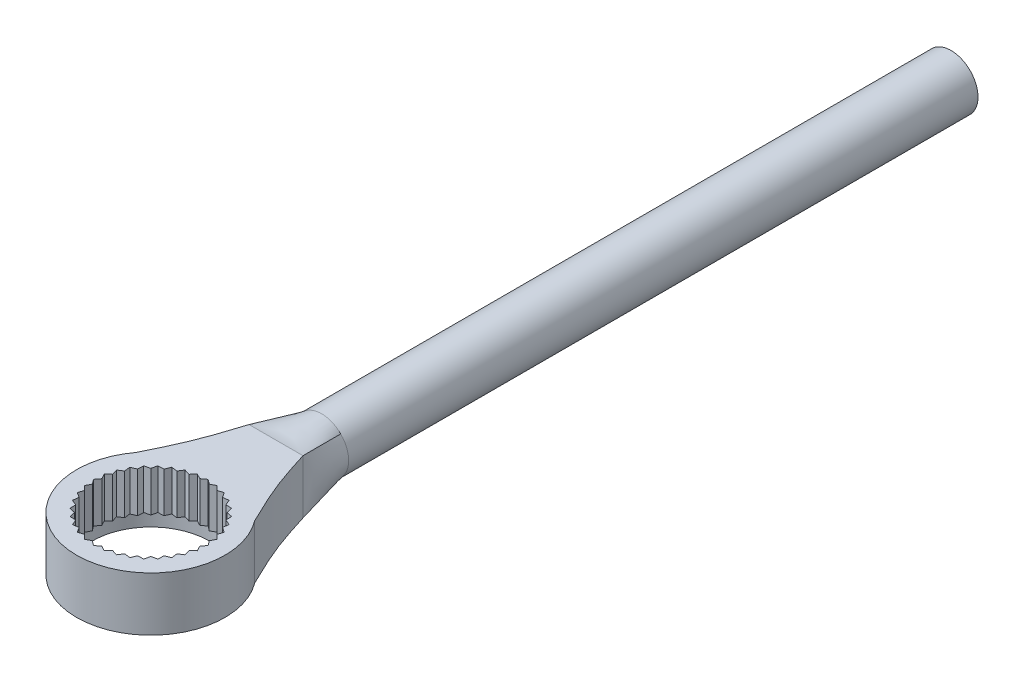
ISO-10303-21;
HEADER;
FILE_DESCRIPTION(('STEP AP214'),'2;1');
FILE_NAME('part.step','',(''),(''),'','','');
FILE_SCHEMA(('AUTOMOTIVE_DESIGN { 1 0 10303 214 1 1 1 1 }'));
ENDSEC;
DATA;
#1=APPLICATION_CONTEXT('core data for automotive mechanical design processes');
#2=APPLICATION_PROTOCOL_DEFINITION('international standard','automotive_design',2000,#1);
#3=PRODUCT_CONTEXT('',#1,'mechanical');
#4=PRODUCT('Part','Part','',(#3));
#5=PRODUCT_RELATED_PRODUCT_CATEGORY('part','',(#4));
#6=PRODUCT_DEFINITION_FORMATION('','',#4);
#7=PRODUCT_DEFINITION_CONTEXT('part definition',#1,'design');
#8=PRODUCT_DEFINITION('design','',#6,#7);
#9=PRODUCT_DEFINITION_SHAPE('','',#8);
#10=(LENGTH_UNIT() NAMED_UNIT(*) SI_UNIT(.MILLI.,.METRE.));
#11=(NAMED_UNIT(*) PLANE_ANGLE_UNIT() SI_UNIT($,.RADIAN.));
#12=(NAMED_UNIT(*) SI_UNIT($,.STERADIAN.) SOLID_ANGLE_UNIT());
#13=UNCERTAINTY_MEASURE_WITH_UNIT(LENGTH_MEASURE(1.E-05),#10,'distance_accuracy_value','');
#14=(GEOMETRIC_REPRESENTATION_CONTEXT(3) GLOBAL_UNCERTAINTY_ASSIGNED_CONTEXT((#13)) GLOBAL_UNIT_ASSIGNED_CONTEXT((#10,
#11,#12)) REPRESENTATION_CONTEXT('',''));
#15=CARTESIAN_POINT('',(0.,0.,0.));
#16=DIRECTION('',(0.,0.,1.));
#17=DIRECTION('',(1.,0.,0.));
#18=AXIS2_PLACEMENT_3D('',#15,#16,#17);
#19=CARTESIAN_POINT('',(0.,6.,178.));
#20=DIRECTION('',(0.,-1.,0.));
#21=DIRECTION('',(0.,0.,-1.));
#22=AXIS2_PLACEMENT_3D('',#19,#20,#21);
#23=CYLINDRICAL_SURFACE('',#22,16.5);
#24=DIRECTION('',(0.,-1.,0.));
#25=VECTOR('',#24,1.);
#26=CARTESIAN_POINT('',(13.1638282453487,37.8370817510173,168.051953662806));
#27=LINE('',#26,#25);
#28=CARTESIAN_POINT('',(13.1638282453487,6.,168.051953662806));
#29=VERTEX_POINT('',#28);
#30=CARTESIAN_POINT('',(13.1638282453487,-6.,168.051953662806));
#31=VERTEX_POINT('',#30);
#32=EDGE_CURVE('E42',#29,#31,#27,.T.);
#33=ORIENTED_EDGE('',*,*,#32,.F.);
#34=CARTESIAN_POINT('',(0.,6.,178.));
#35=DIRECTION('',(0.,1.,0.));
#36=DIRECTION('',(0.,0.,1.));
#37=AXIS2_PLACEMENT_3D('',#34,#35,#36);
#38=CIRCLE('',#37,16.5);
#39=CARTESIAN_POINT('',(-13.1638282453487,6.,168.051953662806));
#40=VERTEX_POINT('',#39);
#41=EDGE_CURVE('E46',#40,#29,#38,.T.);
#42=ORIENTED_EDGE('',*,*,#41,.F.);
#43=DIRECTION('',(0.,-1.,0.));
#44=VECTOR('',#43,1.);
#45=CARTESIAN_POINT('',(-13.1638282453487,37.8370817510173,168.051953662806));
#46=LINE('',#45,#44);
#47=CARTESIAN_POINT('',(-13.1638282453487,-6.00000000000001,168.051953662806));
#48=VERTEX_POINT('',#47);
#49=EDGE_CURVE('E580',#40,#48,#46,.T.);
#50=ORIENTED_EDGE('',*,*,#49,.T.);
#51=CARTESIAN_POINT('',(0.,-6.,178.));
#52=DIRECTION('',(0.,1.,0.));
#53=DIRECTION('',(0.,0.,1.));
#54=AXIS2_PLACEMENT_3D('',#51,#52,#53);
#55=CIRCLE('',#54,16.5);
#56=EDGE_CURVE('E1312',#48,#31,#55,.T.);
#57=ORIENTED_EDGE('',*,*,#56,.T.);
#58=EDGE_LOOP('',(#33,#42,#50,#57));
#59=FACE_BOUND('',#58,.T.);
#60=ADVANCED_FACE('F24',(#59),#23,.T.);
#61=CARTESIAN_POINT('',(0.,6.,178.));
#62=DIRECTION('',(0.,1.,0.));
#63=DIRECTION('',(0.,0.,1.));
#64=AXIS2_PLACEMENT_3D('',#61,#62,#63);
#65=PLANE('',#64);
#66=DIRECTION('',(-1.,0.,0.));
#67=VECTOR('',#66,1.);
#68=CARTESIAN_POINT('',(6.,6.,150.150716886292));
#69=LINE('',#68,#67);
#70=CARTESIAN_POINT('',(6.,6.,150.150716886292));
#71=VERTEX_POINT('',#70);
#72=CARTESIAN_POINT('',(-6.,6.00000000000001,150.150716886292));
#73=VERTEX_POINT('',#72);
#74=EDGE_CURVE('E566',#71,#73,#69,.T.);
#75=ORIENTED_EDGE('',*,*,#74,.T.);
#76=CARTESIAN_POINT('',(-6.,6.00000000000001,150.150716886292));
#77=CARTESIAN_POINT('',(-6.92405983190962,6.00000000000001,153.089144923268));
#78=CARTESIAN_POINT('',(-8.86331688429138,6.00000000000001,159.234555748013));
#79=CARTESIAN_POINT('',(-11.6888202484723,6.00000000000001,165.027724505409));
#80=CARTESIAN_POINT('',(-13.1638282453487,6.00000000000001,168.051953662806));
#81=B_SPLINE_CURVE_WITH_KNOTS('',3,(#76,#77,#78,#79,#80),.UNSPECIFIED.,.F.,.F.,(4,1,4),
(0.00675205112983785,0.481491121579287,1.),.UNSPECIFIED.);
#82=EDGE_CURVE('E560',#73,#40,#81,.T.);
#83=ORIENTED_EDGE('',*,*,#82,.T.);
#84=ORIENTED_EDGE('',*,*,#41,.T.);
#85=CARTESIAN_POINT('',(13.1638282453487,6.00000000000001,168.051953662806));
#86=CARTESIAN_POINT('',(11.6888202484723,6.00000000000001,165.027724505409));
#87=CARTESIAN_POINT('',(8.86331688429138,6.00000000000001,159.234555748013));
#88=CARTESIAN_POINT('',(6.92405983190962,6.00000000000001,153.089144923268));
#89=CARTESIAN_POINT('',(6.,6.00000000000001,150.150716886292));
#90=B_SPLINE_CURVE_WITH_KNOTS('',3,(#85,#86,#87,#88,#89),.UNSPECIFIED.,.F.,.F.,(4,1,4),
(0.00675205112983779,0.52526092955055,1.),.UNSPECIFIED.);
#91=EDGE_CURVE('E572',#29,#71,#90,.T.);
#92=ORIENTED_EDGE('',*,*,#91,.T.);
#93=EDGE_LOOP('',(#75,#83,#84,#92));
#94=FACE_BOUND('',#93,.T.);
#95=DIRECTION('',(-0.386506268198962,0.,-0.922286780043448));
#96=VECTOR('',#95,1.);
#97=CARTESIAN_POINT('',(6.88291723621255,6.,168.170175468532));
#98=LINE('',#97,#96);
#99=CARTESIAN_POINT('',(6.88291723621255,6.,168.170175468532));
#100=VERTEX_POINT('',#99);
#101=CARTESIAN_POINT('',(6.37499999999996,6.,166.958176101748));
#102=VERTEX_POINT('',#101);
#103=EDGE_CURVE('E1613',#100,#102,#98,.T.);
#104=ORIENTED_EDGE('',*,*,#103,.F.);
#105=DIRECTION('',(-0.998859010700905,0.,-0.0477564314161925));
#106=VECTOR('',#105,1.);
#107=CARTESIAN_POINT('',(8.19554202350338,6.,168.232933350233));
#108=LINE('',#107,#106);
#109=CARTESIAN_POINT('',(8.19554202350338,6.,168.232933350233));
#110=VERTEX_POINT('',#109);
#111=EDGE_CURVE('E1610',#110,#100,#108,.T.);
#112=ORIENTED_EDGE('',*,*,#111,.F.);
#113=DIRECTION('',(-0.220480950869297,0.,-0.975391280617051));
#114=VECTOR('',#113,1.);
#115=CARTESIAN_POINT('',(8.48528137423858,6.,169.514718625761));
#116=LINE('',#115,#114);
#117=CARTESIAN_POINT('',(8.48528137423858,6.,169.514718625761));
#118=VERTEX_POINT('',#117);
#119=EDGE_CURVE('E1609',#118,#110,#116,.T.);
#120=ORIENTED_EDGE('',*,*,#119,.F.);
#121=DIRECTION('',(-0.975391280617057,0.,-0.220480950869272));
#122=VECTOR('',#121,1.);
#123=CARTESIAN_POINT('',(9.767066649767,6.,169.804457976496));
#124=LINE('',#123,#122);
#125=CARTESIAN_POINT('',(9.767066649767,6.,169.804457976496));
#126=VERTEX_POINT('',#125);
#127=EDGE_CURVE('E1820',#126,#118,#124,.T.);
#128=ORIENTED_EDGE('',*,*,#127,.F.);
#129=DIRECTION('',(-0.0477564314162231,0.,-0.998859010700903));
#130=VECTOR('',#129,1.);
#131=CARTESIAN_POINT('',(9.82982453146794,6.,171.117082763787));
#132=LINE('',#131,#130);
#133=CARTESIAN_POINT('',(9.82982453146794,6.,171.117082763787));
#134=VERTEX_POINT('',#133);
#135=EDGE_CURVE('E1817',#134,#126,#132,.T.);
#136=ORIENTED_EDGE('',*,*,#135,.F.);
#137=DIRECTION('',(-0.92228678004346,0.,-0.386506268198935));
#138=VECTOR('',#137,1.);
#139=CARTESIAN_POINT('',(11.0418238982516,6.,171.625));
#140=LINE('',#139,#138);
#141=CARTESIAN_POINT('',(11.0418238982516,6.,171.625));
#142=VERTEX_POINT('',#141);
#143=EDGE_CURVE('E1814',#142,#134,#140,.T.);
#144=ORIENTED_EDGE('',*,*,#143,.F.);
#145=DIRECTION('',(0.126419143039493,0.,-0.991976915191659));
#146=VECTOR('',#145,1.);
#147=CARTESIAN_POINT('',(10.8756934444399,6.,172.928580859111));
#148=LINE('',#147,#146);
#149=CARTESIAN_POINT('',(10.8756934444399,6.,172.928580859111));
#150=VERTEX_POINT('',#149);
#151=EDGE_CURVE('E1811',#150,#142,#148,.T.);
#152=ORIENTED_EDGE('',*,*,#151,.F.);
#153=DIRECTION('',(-0.84115906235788,0.,-0.540787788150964));
#154=VECTOR('',#153,1.);
#155=CARTESIAN_POINT('',(11.9810809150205,6.,173.639243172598));
#156=LINE('',#155,#154);
#157=CARTESIAN_POINT('',(11.9810809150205,6.,173.639243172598));
#158=VERTEX_POINT('',#157);
#159=EDGE_CURVE('E1808',#158,#150,#156,.T.);
#160=ORIENTED_EDGE('',*,*,#159,.F.);
#161=DIRECTION('',(0.296753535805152,0.,-0.954954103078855));
#162=VECTOR('',#161,1.);
#163=CARTESIAN_POINT('',(11.591109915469,6.,174.89417145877));
#164=LINE('',#163,#162);
#165=CARTESIAN_POINT('',(11.591109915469,6.,174.89417145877));
#166=VERTEX_POINT('',#165);
#167=EDGE_CURVE('E1805',#166,#158,#164,.T.);
#168=ORIENTED_EDGE('',*,*,#167,.F.);
#169=DIRECTION('',(-0.73447315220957,0.,-0.678637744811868));
#170=VECTOR('',#169,1.);
#171=CARTESIAN_POINT('',(12.5562988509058,6.,175.785985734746));
#172=LINE('',#171,#170);
#173=CARTESIAN_POINT('',(12.5562988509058,6.,175.785985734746));
#174=VERTEX_POINT('',#173);
#175=EDGE_CURVE('E1802',#174,#166,#172,.T.);
#176=ORIENTED_EDGE('',*,*,#175,.F.);
#177=DIRECTION('',(0.458071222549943,0.,-0.888915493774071));
#178=VECTOR('',#177,1.);
#179=CARTESIAN_POINT('',(11.9543363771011,6.,176.954131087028));
#180=LINE('',#179,#178);
#181=CARTESIAN_POINT('',(11.9543363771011,6.,176.954131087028));
#182=VERTEX_POINT('',#181);
#183=EDGE_CURVE('E1799',#182,#174,#180,.T.);
#184=ORIENTED_EDGE('',*,*,#183,.F.);
#185=DIRECTION('',(-0.605470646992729,0.,-0.795867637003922));
#186=VECTOR('',#185,1.);
#187=CARTESIAN_POINT('',(12.7500000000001,6.,178.));
#188=LINE('',#187,#186);
#189=CARTESIAN_POINT('',(12.7500000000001,6.,178.));
#190=VERTEX_POINT('',#189);
#191=EDGE_CURVE('E1796',#190,#182,#188,.T.);
#192=ORIENTED_EDGE('',*,*,#191,.F.);
#193=DIRECTION('',(0.605470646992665,0.,-0.79586763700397));
#194=VECTOR('',#193,1.);
#195=CARTESIAN_POINT('',(11.9543363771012,6.,179.045868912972));
#196=LINE('',#195,#194);
#197=CARTESIAN_POINT('',(11.9543363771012,6.,179.045868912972));
#198=VERTEX_POINT('',#197);
#199=EDGE_CURVE('E1793',#198,#190,#196,.T.);
#200=ORIENTED_EDGE('',*,*,#199,.F.);
#201=DIRECTION('',(-0.458071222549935,0.,-0.888915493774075));
#202=VECTOR('',#201,1.);
#203=CARTESIAN_POINT('',(12.5562988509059,6.,180.214014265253));
#204=LINE('',#203,#202);
#205=CARTESIAN_POINT('',(12.5562988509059,6.,180.214014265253));
#206=VERTEX_POINT('',#205);
#207=EDGE_CURVE('E1790',#206,#198,#204,.T.);
#208=ORIENTED_EDGE('',*,*,#207,.F.);
#209=DIRECTION('',(0.734473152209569,0.,-0.678637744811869));
#210=VECTOR('',#209,1.);
#211=CARTESIAN_POINT('',(11.591109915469,6.,181.10582854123));
#212=LINE('',#211,#210);
#213=CARTESIAN_POINT('',(11.591109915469,6.,181.10582854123));
#214=VERTEX_POINT('',#213);
#215=EDGE_CURVE('E1787',#214,#206,#212,.T.);
#216=ORIENTED_EDGE('',*,*,#215,.F.);
#217=DIRECTION('',(-0.29675353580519,0.,-0.954954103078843));
#218=VECTOR('',#217,1.);
#219=CARTESIAN_POINT('',(11.9810809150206,6.,182.360756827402));
#220=LINE('',#219,#218);
#221=CARTESIAN_POINT('',(11.9810809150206,6.,182.360756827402));
#222=VERTEX_POINT('',#221);
#223=EDGE_CURVE('E1784',#222,#214,#220,.T.);
#224=ORIENTED_EDGE('',*,*,#223,.F.);
#225=DIRECTION('',(0.841159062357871,0.,-0.540787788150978));
#226=VECTOR('',#225,1.);
#227=CARTESIAN_POINT('',(10.87569344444,6.,183.071419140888));
#228=LINE('',#227,#226);
#229=CARTESIAN_POINT('',(10.87569344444,6.,183.071419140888));
#230=VERTEX_POINT('',#229);
#231=EDGE_CURVE('E1781',#230,#222,#228,.T.);
#232=ORIENTED_EDGE('',*,*,#231,.F.);
#233=DIRECTION('',(-0.126419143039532,0.,-0.991976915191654));
#234=VECTOR('',#233,1.);
#235=CARTESIAN_POINT('',(11.0418238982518,6.,184.375));
#236=LINE('',#235,#234);
#237=CARTESIAN_POINT('',(11.0418238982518,6.,184.375));
#238=VERTEX_POINT('',#237);
#239=EDGE_CURVE('E1778',#238,#230,#236,.T.);
#240=ORIENTED_EDGE('',*,*,#239,.F.);
#241=DIRECTION('',(0.922286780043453,0.,-0.38650626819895));
#242=VECTOR('',#241,1.);
#243=CARTESIAN_POINT('',(9.82982453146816,6.,184.882917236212));
#244=LINE('',#243,#242);
#245=CARTESIAN_POINT('',(9.82982453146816,6.,184.882917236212));
#246=VERTEX_POINT('',#245);
#247=EDGE_CURVE('E1775',#246,#238,#244,.T.);
#248=ORIENTED_EDGE('',*,*,#247,.F.);
#249=DIRECTION('',(0.0477564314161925,0.,-0.998859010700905));
#250=VECTOR('',#249,1.);
#251=CARTESIAN_POINT('',(9.76706664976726,6.,186.195542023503));
#252=LINE('',#251,#250);
#253=CARTESIAN_POINT('',(9.76706664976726,6.,186.195542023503));
#254=VERTEX_POINT('',#253);
#255=EDGE_CURVE('E1772',#254,#246,#252,.T.);
#256=ORIENTED_EDGE('',*,*,#255,.F.);
#257=DIRECTION('',(0.975391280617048,0.,-0.220480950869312));
#258=VECTOR('',#257,1.);
#259=CARTESIAN_POINT('',(8.48528137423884,6.,186.485281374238));
#260=LINE('',#259,#258);
#261=CARTESIAN_POINT('',(8.48528137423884,6.,186.485281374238));
#262=VERTEX_POINT('',#261);
#263=EDGE_CURVE('E1769',#262,#254,#260,.T.);
#264=ORIENTED_EDGE('',*,*,#263,.F.);
#265=DIRECTION('',(0.220480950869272,0.,-0.975391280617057));
#266=VECTOR('',#265,1.);
#267=CARTESIAN_POINT('',(8.19554202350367,6.,187.767066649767));
#268=LINE('',#267,#266);
#269=CARTESIAN_POINT('',(8.19554202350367,6.,187.767066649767));
#270=VERTEX_POINT('',#269);
#271=EDGE_CURVE('E1766',#270,#262,#268,.T.);
#272=ORIENTED_EDGE('',*,*,#271,.F.);
#273=DIRECTION('',(0.998859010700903,0.,-0.0477564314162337));
#274=VECTOR('',#273,1.);
#275=CARTESIAN_POINT('',(6.88291723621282,6.,187.829824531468));
#276=LINE('',#275,#274);
#277=CARTESIAN_POINT('',(6.88291723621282,6.,187.829824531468));
#278=VERTEX_POINT('',#277);
#279=EDGE_CURVE('E1763',#278,#270,#276,.T.);
#280=ORIENTED_EDGE('',*,*,#279,.F.);
#281=DIRECTION('',(0.386506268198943,0.,-0.922286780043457));
#282=VECTOR('',#281,1.);
#283=CARTESIAN_POINT('',(6.37500000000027,6.,189.041823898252));
#284=LINE('',#283,#282);
#285=CARTESIAN_POINT('',(6.37500000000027,6.,189.041823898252));
#286=VERTEX_POINT('',#285);
#287=EDGE_CURVE('E1760',#286,#278,#284,.T.);
#288=ORIENTED_EDGE('',*,*,#287,.F.);
#289=DIRECTION('',(0.991976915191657,0.,0.126419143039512));
#290=VECTOR('',#289,1.);
#291=CARTESIAN_POINT('',(5.07141914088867,6.,188.87569344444));
#292=LINE('',#291,#290);
#293=CARTESIAN_POINT('',(5.07141914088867,6.,188.87569344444));
#294=VERTEX_POINT('',#293);
#295=EDGE_CURVE('E1757',#294,#286,#292,.T.);
#296=ORIENTED_EDGE('',*,*,#295,.F.);
#297=DIRECTION('',(0.540787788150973,0.,-0.841159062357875));
#298=VECTOR('',#297,1.);
#299=CARTESIAN_POINT('',(4.36075682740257,6.,189.98108091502));
#300=LINE('',#299,#298);
#301=CARTESIAN_POINT('',(4.36075682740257,6.,189.98108091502));
#302=VERTEX_POINT('',#301);
#303=EDGE_CURVE('E1754',#302,#294,#300,.T.);
#304=ORIENTED_EDGE('',*,*,#303,.F.);
#305=DIRECTION('',(0.954954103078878,0.,0.296753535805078));
#306=VECTOR('',#305,1.);
#307=CARTESIAN_POINT('',(3.10582854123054,6.,189.591109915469));
#308=LINE('',#307,#306);
#309=CARTESIAN_POINT('',(3.10582854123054,6.,189.591109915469));
#310=VERTEX_POINT('',#309);
#311=EDGE_CURVE('E1751',#310,#302,#308,.T.);
#312=ORIENTED_EDGE('',*,*,#311,.F.);
#313=DIRECTION('',(0.678637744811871,0.,-0.734473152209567));
#314=VECTOR('',#313,1.);
#315=CARTESIAN_POINT('',(2.21401426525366,6.,190.556298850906));
#316=LINE('',#315,#314);
#317=CARTESIAN_POINT('',(2.21401426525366,6.,190.556298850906));
#318=VERTEX_POINT('',#317);
#319=EDGE_CURVE('E1748',#318,#310,#316,.T.);
#320=ORIENTED_EDGE('',*,*,#319,.F.);
#321=DIRECTION('',(0.888915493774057,0.,0.45807122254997));
#322=VECTOR('',#321,1.);
#323=CARTESIAN_POINT('',(1.0458689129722,6.,189.954336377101));
#324=LINE('',#323,#322);
#325=CARTESIAN_POINT('',(1.0458689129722,6.,189.954336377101));
#326=VERTEX_POINT('',#325);
#327=EDGE_CURVE('E1745',#326,#318,#324,.T.);
#328=ORIENTED_EDGE('',*,*,#327,.F.);
#329=DIRECTION('',(0.795867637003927,0.,-0.605470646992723));
#330=VECTOR('',#329,1.);
#331=CARTESIAN_POINT('',(3.12250225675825E-13,6.,190.75));
#332=LINE('',#331,#330);
#333=CARTESIAN_POINT('',(3.12250225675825E-13,6.,190.75));
#334=VERTEX_POINT('',#333);
#335=EDGE_CURVE('E1742',#334,#326,#332,.T.);
#336=ORIENTED_EDGE('',*,*,#335,.F.);
#337=DIRECTION('',(0.795867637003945,0.,0.605470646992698));
#338=VECTOR('',#337,1.);
#339=CARTESIAN_POINT('',(-1.0458689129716,6.,189.954336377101));
#340=LINE('',#339,#338);
#341=CARTESIAN_POINT('',(-1.0458689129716,6.,189.954336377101));
#342=VERTEX_POINT('',#341);
#343=EDGE_CURVE('E1739',#342,#334,#340,.T.);
#344=ORIENTED_EDGE('',*,*,#343,.F.);
#345=DIRECTION('',(0.888915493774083,0.,-0.45807122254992));
#346=VECTOR('',#345,1.);
#347=CARTESIAN_POINT('',(-2.21401426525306,6.,190.556298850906));
#348=LINE('',#347,#346);
#349=CARTESIAN_POINT('',(-2.21401426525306,6.,190.556298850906));
#350=VERTEX_POINT('',#349);
#351=EDGE_CURVE('E1736',#350,#342,#348,.T.);
#352=ORIENTED_EDGE('',*,*,#351,.F.);
#353=DIRECTION('',(0.678637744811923,0.,0.734473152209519));
#354=VECTOR('',#353,1.);
#355=CARTESIAN_POINT('',(-3.10582854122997,6.,189.591109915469));
#356=LINE('',#355,#354);
#357=CARTESIAN_POINT('',(-3.10582854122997,6.,189.591109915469));
#358=VERTEX_POINT('',#357);
#359=EDGE_CURVE('E1733',#358,#350,#356,.T.);
#360=ORIENTED_EDGE('',*,*,#359,.F.);
#361=DIRECTION('',(0.954954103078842,0.,-0.296753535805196));
#362=VECTOR('',#361,1.);
#363=CARTESIAN_POINT('',(-4.36075682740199,6.,189.98108091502));
#364=LINE('',#363,#362);
#365=CARTESIAN_POINT('',(-4.36075682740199,6.,189.98108091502));
#366=VERTEX_POINT('',#365);
#367=EDGE_CURVE('E1730',#366,#358,#364,.T.);
#368=ORIENTED_EDGE('',*,*,#367,.F.);
#369=DIRECTION('',(0.540787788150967,0.,0.841159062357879));
#370=VECTOR('',#369,1.);
#371=CARTESIAN_POINT('',(-5.07141914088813,6.,188.87569344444));
#372=LINE('',#371,#370);
#373=CARTESIAN_POINT('',(-5.07141914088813,6.,188.87569344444));
#374=VERTEX_POINT('',#373);
#375=EDGE_CURVE('E1727',#374,#366,#372,.T.);
#376=ORIENTED_EDGE('',*,*,#375,.F.);
#377=DIRECTION('',(0.991976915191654,0.,-0.126419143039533));
#378=VECTOR('',#377,1.);
#379=CARTESIAN_POINT('',(-6.37499999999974,6.,189.041823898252));
#380=LINE('',#379,#378);
#381=CARTESIAN_POINT('',(-6.37499999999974,6.,189.041823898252));
#382=VERTEX_POINT('',#381);
#383=EDGE_CURVE('E1724',#382,#374,#380,.T.);
#384=ORIENTED_EDGE('',*,*,#383,.F.);
#385=DIRECTION('',(0.386506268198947,0.,0.922286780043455));
#386=VECTOR('',#385,1.);
#387=CARTESIAN_POINT('',(-6.88291723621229,6.,187.829824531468));
#388=LINE('',#387,#386);
#389=CARTESIAN_POINT('',(-6.88291723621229,6.,187.829824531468));
#390=VERTEX_POINT('',#389);
#391=EDGE_CURVE('E1721',#390,#382,#388,.T.);
#392=ORIENTED_EDGE('',*,*,#391,.F.);
#393=DIRECTION('',(0.998859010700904,0.,0.0477564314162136));
#394=VECTOR('',#393,1.);
#395=CARTESIAN_POINT('',(-8.19554202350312,6.,187.767066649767));
#396=LINE('',#395,#394);
#397=CARTESIAN_POINT('',(-8.19554202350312,6.,187.767066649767));
#398=VERTEX_POINT('',#397);
#399=EDGE_CURVE('E1718',#398,#390,#396,.T.);
#400=ORIENTED_EDGE('',*,*,#399,.F.);
#401=DIRECTION('',(0.220480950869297,0.,0.975391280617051));
#402=VECTOR('',#401,1.);
#403=CARTESIAN_POINT('',(-8.48528137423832,6.,186.485281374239));
#404=LINE('',#403,#402);
#405=CARTESIAN_POINT('',(-8.48528137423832,6.,186.485281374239));
#406=VERTEX_POINT('',#405);
#407=EDGE_CURVE('E1715',#406,#398,#404,.T.);
#408=ORIENTED_EDGE('',*,*,#407,.F.);
#409=DIRECTION('',(0.975391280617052,0.,0.220480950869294));
#410=VECTOR('',#409,1.);
#411=CARTESIAN_POINT('',(-9.76706664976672,6.,186.195542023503));
#412=LINE('',#411,#410);
#413=CARTESIAN_POINT('',(-9.76706664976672,6.,186.195542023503));
#414=VERTEX_POINT('',#413);
#415=EDGE_CURVE('E1712',#414,#406,#412,.T.);
#416=ORIENTED_EDGE('',*,*,#415,.F.);
#417=DIRECTION('',(0.0477564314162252,0.,0.998859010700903));
#418=VECTOR('',#417,1.);
#419=CARTESIAN_POINT('',(-9.82982453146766,6.,184.882917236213));
#420=LINE('',#419,#418);
#421=CARTESIAN_POINT('',(-9.82982453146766,6.,184.882917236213));
#422=VERTEX_POINT('',#421);
#423=EDGE_CURVE('E1709',#422,#414,#420,.T.);
#424=ORIENTED_EDGE('',*,*,#423,.F.);
#425=DIRECTION('',(0.922286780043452,0.,0.386506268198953));
#426=VECTOR('',#425,1.);
#427=CARTESIAN_POINT('',(-11.0418238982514,6.,184.375));
#428=LINE('',#427,#426);
#429=CARTESIAN_POINT('',(-11.0418238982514,6.,184.375));
#430=VERTEX_POINT('',#429);
#431=EDGE_CURVE('E1706',#430,#422,#428,.T.);
#432=ORIENTED_EDGE('',*,*,#431,.F.);
#433=DIRECTION('',(-0.126419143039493,0.,0.991976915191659));
#434=VECTOR('',#433,1.);
#435=CARTESIAN_POINT('',(-10.8756934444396,6.,183.071419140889));
#436=LINE('',#435,#434);
#437=CARTESIAN_POINT('',(-10.8756934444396,6.,183.071419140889));
#438=VERTEX_POINT('',#437);
#439=EDGE_CURVE('E1703',#438,#430,#436,.T.);
#440=ORIENTED_EDGE('',*,*,#439,.F.);
#441=DIRECTION('',(0.841159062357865,0.,0.540787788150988));
#442=VECTOR('',#441,1.);
#443=CARTESIAN_POINT('',(-11.9810809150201,6.,182.360756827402));
#444=LINE('',#443,#442);
#445=CARTESIAN_POINT('',(-11.9810809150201,6.,182.360756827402));
#446=VERTEX_POINT('',#445);
#447=EDGE_CURVE('E1700',#446,#438,#444,.T.);
#448=ORIENTED_EDGE('',*,*,#447,.F.);
#449=DIRECTION('',(-0.296753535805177,0.,0.954954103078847));
#450=VECTOR('',#449,1.);
#451=CARTESIAN_POINT('',(-11.5911099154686,6.,181.10582854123));
#452=LINE('',#451,#450);
#453=CARTESIAN_POINT('',(-11.5911099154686,6.,181.10582854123));
#454=VERTEX_POINT('',#453);
#455=EDGE_CURVE('E1697',#454,#446,#452,.T.);
#456=ORIENTED_EDGE('',*,*,#455,.F.);
#457=DIRECTION('',(0.73447315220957,0.,0.678637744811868));
#458=VECTOR('',#457,1.);
#459=CARTESIAN_POINT('',(-12.5562988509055,6.,180.214014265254));
#460=LINE('',#459,#458);
#461=CARTESIAN_POINT('',(-12.5562988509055,6.,180.214014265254));
#462=VERTEX_POINT('',#461);
#463=EDGE_CURVE('E1694',#462,#454,#460,.T.);
#464=ORIENTED_EDGE('',*,*,#463,.F.);
#465=DIRECTION('',(-0.458071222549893,0.,0.888915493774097));
#466=VECTOR('',#465,1.);
#467=CARTESIAN_POINT('',(-11.9543363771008,6.,179.045868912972));
#468=LINE('',#467,#466);
#469=CARTESIAN_POINT('',(-11.9543363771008,6.,179.045868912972));
#470=VERTEX_POINT('',#469);
#471=EDGE_CURVE('E1691',#470,#462,#468,.T.);
#472=ORIENTED_EDGE('',*,*,#471,.F.);
#473=DIRECTION('',(0.605470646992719,0.,0.79586763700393));
#474=VECTOR('',#473,1.);
#475=CARTESIAN_POINT('',(-12.7499999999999,6.,178.));
#476=LINE('',#475,#474);
#477=CARTESIAN_POINT('',(-12.7499999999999,6.,178.));
#478=VERTEX_POINT('',#477);
#479=EDGE_CURVE('E1688',#478,#470,#476,.T.);
#480=ORIENTED_EDGE('',*,*,#479,.F.);
#481=DIRECTION('',(-0.605470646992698,0.,0.795867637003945));
#482=VECTOR('',#481,1.);
#483=CARTESIAN_POINT('',(-11.9543363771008,6.,176.954131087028));
#484=LINE('',#483,#482);
#485=CARTESIAN_POINT('',(-11.9543363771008,6.,176.954131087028));
#486=VERTEX_POINT('',#485);
#487=EDGE_CURVE('E1685',#486,#478,#484,.T.);
#488=ORIENTED_EDGE('',*,*,#487,.F.);
#489=DIRECTION('',(0.458071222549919,0.,0.888915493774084));
#490=VECTOR('',#489,1.);
#491=CARTESIAN_POINT('',(-12.5562988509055,6.,175.785985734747));
#492=LINE('',#491,#490);
#493=CARTESIAN_POINT('',(-12.5562988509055,6.,175.785985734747));
#494=VERTEX_POINT('',#493);
#495=EDGE_CURVE('E1682',#494,#486,#492,.T.);
#496=ORIENTED_EDGE('',*,*,#495,.F.);
#497=DIRECTION('',(-0.734473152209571,0.,0.678637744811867));
#498=VECTOR('',#497,1.);
#499=CARTESIAN_POINT('',(-11.5911099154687,6.,174.89417145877));
#500=LINE('',#499,#498);
#501=CARTESIAN_POINT('',(-11.5911099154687,6.,174.89417145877));
#502=VERTEX_POINT('',#501);
#503=EDGE_CURVE('E1679',#502,#494,#500,.T.);
#504=ORIENTED_EDGE('',*,*,#503,.F.);
#505=DIRECTION('',(0.296753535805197,0.,0.954954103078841));
#506=VECTOR('',#505,1.);
#507=CARTESIAN_POINT('',(-11.9810809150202,6.,173.639243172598));
#508=LINE('',#507,#506);
#509=CARTESIAN_POINT('',(-11.9810809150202,6.,173.639243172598));
#510=VERTEX_POINT('',#509);
#511=EDGE_CURVE('E1676',#510,#502,#508,.T.);
#512=ORIENTED_EDGE('',*,*,#511,.F.);
#513=DIRECTION('',(-0.841159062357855,0.,0.540787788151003));
#514=VECTOR('',#513,1.);
#515=CARTESIAN_POINT('',(-10.8756934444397,6.,172.928580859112));
#516=LINE('',#515,#514);
#517=CARTESIAN_POINT('',(-10.8756934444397,6.,172.928580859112));
#518=VERTEX_POINT('',#517);
#519=EDGE_CURVE('E1673',#518,#510,#516,.T.);
#520=ORIENTED_EDGE('',*,*,#519,.F.);
#521=DIRECTION('',(0.126419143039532,0.,0.991976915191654));
#522=VECTOR('',#521,1.);
#523=CARTESIAN_POINT('',(-11.0418238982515,6.,171.625));
#524=LINE('',#523,#522);
#525=CARTESIAN_POINT('',(-11.0418238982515,6.,171.625));
#526=VERTEX_POINT('',#525);
#527=EDGE_CURVE('E1670',#526,#518,#524,.T.);
#528=ORIENTED_EDGE('',*,*,#527,.F.);
#529=DIRECTION('',(-0.922286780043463,0.,0.386506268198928));
#530=VECTOR('',#529,1.);
#531=CARTESIAN_POINT('',(-9.82982453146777,6.,171.117082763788));
#532=LINE('',#531,#530);
#533=CARTESIAN_POINT('',(-9.82982453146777,6.,171.117082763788));
#534=VERTEX_POINT('',#533);
#535=EDGE_CURVE('E1667',#534,#526,#532,.T.);
#536=ORIENTED_EDGE('',*,*,#535,.F.);
#537=DIRECTION('',(-0.0477564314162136,0.,0.998859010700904));
#538=VECTOR('',#537,1.);
#539=CARTESIAN_POINT('',(-9.76706664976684,6.,169.804457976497));
#540=LINE('',#539,#538);
#541=CARTESIAN_POINT('',(-9.76706664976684,6.,169.804457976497));
#542=VERTEX_POINT('',#541);
#543=EDGE_CURVE('E1664',#542,#534,#540,.T.);
#544=ORIENTED_EDGE('',*,*,#543,.F.);
#545=DIRECTION('',(-0.975391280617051,0.,0.220480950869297));
#546=VECTOR('',#545,1.);
#547=CARTESIAN_POINT('',(-8.48528137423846,6.,169.514718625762));
#548=LINE('',#547,#546);
#549=CARTESIAN_POINT('',(-8.48528137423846,6.,169.514718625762));
#550=VERTEX_POINT('',#549);
#551=EDGE_CURVE('E1661',#550,#542,#548,.T.);
#552=ORIENTED_EDGE('',*,*,#551,.F.);
#553=DIRECTION('',(-0.220480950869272,0.,0.975391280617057));
#554=VECTOR('',#553,1.);
#555=CARTESIAN_POINT('',(-8.19554202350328,6.,168.232933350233));
#556=LINE('',#555,#554);
#557=CARTESIAN_POINT('',(-8.19554202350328,6.,168.232933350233));
#558=VERTEX_POINT('',#557);
#559=EDGE_CURVE('E1658',#558,#550,#556,.T.);
#560=ORIENTED_EDGE('',*,*,#559,.F.);
#561=DIRECTION('',(-0.998859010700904,0.,0.0477564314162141));
#562=VECTOR('',#561,1.);
#563=CARTESIAN_POINT('',(-6.88291723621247,6.,168.170175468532));
#564=LINE('',#563,#562);
#565=CARTESIAN_POINT('',(-6.88291723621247,6.,168.170175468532));
#566=VERTEX_POINT('',#565);
#567=EDGE_CURVE('E1655',#566,#558,#564,.T.);
#568=ORIENTED_EDGE('',*,*,#567,.F.);
#569=DIRECTION('',(-0.386506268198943,0.,0.922286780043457));
#570=VECTOR('',#569,1.);
#571=CARTESIAN_POINT('',(-6.37499999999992,6.,166.958176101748));
#572=LINE('',#571,#570);
#573=CARTESIAN_POINT('',(-6.37499999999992,6.,166.958176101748));
#574=VERTEX_POINT('',#573);
#575=EDGE_CURVE('E1652',#574,#566,#572,.T.);
#576=ORIENTED_EDGE('',*,*,#575,.F.);
#577=DIRECTION('',(-0.99197691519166,0.,-0.126419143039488));
#578=VECTOR('',#577,1.);
#579=CARTESIAN_POINT('',(-5.07141914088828,6.,167.12430655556));
#580=LINE('',#579,#578);
#581=CARTESIAN_POINT('',(-5.07141914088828,6.,167.12430655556));
#582=VERTEX_POINT('',#581);
#583=EDGE_CURVE('E1649',#582,#574,#580,.T.);
#584=ORIENTED_EDGE('',*,*,#583,.F.);
#585=DIRECTION('',(-0.54078778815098,0.,0.84115906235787));
#586=VECTOR('',#585,1.);
#587=CARTESIAN_POINT('',(-4.36075682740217,6.,166.01891908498));
#588=LINE('',#587,#586);
#589=CARTESIAN_POINT('',(-4.36075682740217,6.,166.01891908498));
#590=VERTEX_POINT('',#589);
#591=EDGE_CURVE('E1646',#590,#582,#588,.T.);
#592=ORIENTED_EDGE('',*,*,#591,.F.);
#593=DIRECTION('',(-0.954954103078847,0.,-0.296753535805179));
#594=VECTOR('',#593,1.);
#595=CARTESIAN_POINT('',(-3.10582854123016,6.,166.408890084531));
#596=LINE('',#595,#594);
#597=CARTESIAN_POINT('',(-3.10582854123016,6.,166.408890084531));
#598=VERTEX_POINT('',#597);
#599=EDGE_CURVE('E1643',#598,#590,#596,.T.);
#600=ORIENTED_EDGE('',*,*,#599,.F.);
#601=DIRECTION('',(-0.678637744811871,0.,0.734473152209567));
#602=VECTOR('',#601,1.);
#603=CARTESIAN_POINT('',(-2.21401426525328,6.,165.443701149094));
#604=LINE('',#603,#602);
#605=CARTESIAN_POINT('',(-2.21401426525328,6.,165.443701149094));
#606=VERTEX_POINT('',#605);
#607=EDGE_CURVE('E1640',#606,#598,#604,.T.);
#608=ORIENTED_EDGE('',*,*,#607,.F.);
#609=DIRECTION('',(-0.888915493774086,0.,-0.458071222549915));
#610=VECTOR('',#609,1.);
#611=CARTESIAN_POINT('',(-1.0458689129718,6.,166.045663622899));
#612=LINE('',#611,#610);
#613=CARTESIAN_POINT('',(-1.0458689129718,6.,166.045663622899));
#614=VERTEX_POINT('',#613);
#615=EDGE_CURVE('E1637',#614,#606,#612,.T.);
#616=ORIENTED_EDGE('',*,*,#615,.F.);
#617=DIRECTION('',(-0.795867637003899,0.,0.605470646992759));
#618=VECTOR('',#617,1.);
#619=CARTESIAN_POINT('',(0.,6.,165.25));
#620=LINE('',#619,#618);
#621=CARTESIAN_POINT('',(0.,6.,165.25));
#622=VERTEX_POINT('',#621);
#623=EDGE_CURVE('E1634',#622,#614,#620,.T.);
#624=ORIENTED_EDGE('',*,*,#623,.F.);
#625=DIRECTION('',(-0.795867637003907,0.,-0.605470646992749));
#626=VECTOR('',#625,1.);
#627=CARTESIAN_POINT('',(1.04586891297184,6.,166.045663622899));
#628=LINE('',#627,#626);
#629=CARTESIAN_POINT('',(1.04586891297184,6.,166.045663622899));
#630=VERTEX_POINT('',#629);
#631=EDGE_CURVE('E1631',#630,#622,#628,.T.);
#632=ORIENTED_EDGE('',*,*,#631,.F.);
#633=DIRECTION('',(-0.888915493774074,0.,0.458071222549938));
#634=VECTOR('',#633,1.);
#635=CARTESIAN_POINT('',(2.21401426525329,6.,165.443701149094));
#636=LINE('',#635,#634);
#637=CARTESIAN_POINT('',(2.21401426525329,6.,165.443701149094));
#638=VERTEX_POINT('',#637);
#639=EDGE_CURVE('E1628',#638,#630,#636,.T.);
#640=ORIENTED_EDGE('',*,*,#639,.F.);
#641=DIRECTION('',(-0.678637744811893,0.,-0.734473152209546));
#642=VECTOR('',#641,1.);
#643=CARTESIAN_POINT('',(3.1058285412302,6.,166.408890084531));
#644=LINE('',#643,#642);
#645=CARTESIAN_POINT('',(3.1058285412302,6.,166.408890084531));
#646=VERTEX_POINT('',#645);
#647=EDGE_CURVE('E1625',#646,#638,#644,.T.);
#648=ORIENTED_EDGE('',*,*,#647,.F.);
#649=DIRECTION('',(-0.954954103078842,0.,0.296753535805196));
#650=VECTOR('',#649,1.);
#651=CARTESIAN_POINT('',(4.36075682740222,6.,166.01891908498));
#652=LINE('',#651,#650);
#653=CARTESIAN_POINT('',(4.36075682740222,6.,166.01891908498));
#654=VERTEX_POINT('',#653);
#655=EDGE_CURVE('E1622',#654,#646,#652,.T.);
#656=ORIENTED_EDGE('',*,*,#655,.F.);
#657=DIRECTION('',(-0.540787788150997,0.,-0.841159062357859));
#658=VECTOR('',#657,1.);
#659=CARTESIAN_POINT('',(5.07141914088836,6.,167.12430655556));
#660=LINE('',#659,#658);
#661=CARTESIAN_POINT('',(5.07141914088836,6.,167.12430655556));
#662=VERTEX_POINT('',#661);
#663=EDGE_CURVE('E1619',#662,#654,#660,.T.);
#664=ORIENTED_EDGE('',*,*,#663,.F.);
#665=DIRECTION('',(-0.991976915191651,0.,0.126419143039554));
#666=VECTOR('',#665,1.);
#667=CARTESIAN_POINT('',(6.37499999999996,6.,166.958176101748));
#668=LINE('',#667,#666);
#669=EDGE_CURVE('E1616',#102,#662,#668,.T.);
#670=ORIENTED_EDGE('',*,*,#669,.F.);
#671=EDGE_LOOP('',(#104,#112,#120,#128,#136,#144,#152,#160,#168,#176,#184,#192,#200,#208,#216,
#224,#232,#240,#248,#256,#264,#272,#280,#288,#296,#304,#312,#320,#328,#336,#344,#352,#360,#368,
#376,#384,#392,#400,#408,#416,#424,#432,#440,#448,#456,#464,#472,#480,#488,#496,#504,#512,#520,
#528,#536,#544,#552,#560,#568,#576,#584,#592,#600,#608,#616,#624,#632,#640,#648,#656,#664,#670));
#672=FACE_BOUND('',#671,.T.);
#673=ADVANCED_FACE('F909',(#94,#672),#65,.T.);
#674=CARTESIAN_POINT('',(0.,-6.,178.));
#675=DIRECTION('',(0.,1.,0.));
#676=DIRECTION('',(0.,0.,1.));
#677=AXIS2_PLACEMENT_3D('',#674,#675,#676);
#678=PLANE('',#677);
#679=CARTESIAN_POINT('',(-6.,-6.00000000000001,150.150716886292));
#680=CARTESIAN_POINT('',(-6.92405983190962,-6.00000000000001,153.089144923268));
#681=CARTESIAN_POINT('',(-8.86331688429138,-6.00000000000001,159.234555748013));
#682=CARTESIAN_POINT('',(-11.6888202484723,-6.00000000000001,165.027724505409));
#683=CARTESIAN_POINT('',(-13.1638282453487,-6.00000000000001,168.051953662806));
#684=B_SPLINE_CURVE_WITH_KNOTS('',3,(#679,#680,#681,#682,#683),.UNSPECIFIED.,.F.,.F.,(4,1,4),
(0.00675205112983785,0.481491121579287,1.),.UNSPECIFIED.);
#685=CARTESIAN_POINT('',(-6.,-6.,150.150716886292));
#686=VERTEX_POINT('',#685);
#687=EDGE_CURVE('E542',#48,#686,#684,.F.);
#688=ORIENTED_EDGE('',*,*,#687,.T.);
#689=DIRECTION('',(1.,0.,0.));
#690=VECTOR('',#689,1.);
#691=CARTESIAN_POINT('',(6.,-6.,150.150716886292));
#692=LINE('',#691,#690);
#693=CARTESIAN_POINT('',(6.,-6.,150.150716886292));
#694=VERTEX_POINT('',#693);
#695=EDGE_CURVE('E28',#686,#694,#692,.T.);
#696=ORIENTED_EDGE('',*,*,#695,.T.);
#697=CARTESIAN_POINT('',(13.1638282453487,-6.00000000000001,168.051953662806));
#698=CARTESIAN_POINT('',(11.6888202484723,-6.00000000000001,165.027724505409));
#699=CARTESIAN_POINT('',(8.86331688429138,-6.00000000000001,159.234555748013));
#700=CARTESIAN_POINT('',(6.92405983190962,-6.00000000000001,153.089144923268));
#701=CARTESIAN_POINT('',(6.,-6.00000000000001,150.150716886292));
#702=B_SPLINE_CURVE_WITH_KNOTS('',3,(#697,#698,#699,#700,#701),.UNSPECIFIED.,.F.,.F.,(4,1,4),
(0.00675205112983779,0.52526092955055,1.),.UNSPECIFIED.);
#703=EDGE_CURVE('E548',#694,#31,#702,.F.);
#704=ORIENTED_EDGE('',*,*,#703,.T.);
#705=ORIENTED_EDGE('',*,*,#56,.F.);
#706=EDGE_LOOP('',(#688,#696,#704,#705));
#707=FACE_BOUND('',#706,.T.);
#708=CARTESIAN_POINT('',(0.,-6.,178.));
#709=DIRECTION('',(0.,-1.,0.));
#710=DIRECTION('',(0.,0.,-1.));
#711=AXIS2_PLACEMENT_3D('',#708,#709,#710);
#712=CIRCLE('',#711,13.);
#713=CARTESIAN_POINT('',(0.,-6.,165.));
#714=VERTEX_POINT('',#713);
#715=EDGE_CURVE('E565',#714,#714,#712,.T.);
#716=ORIENTED_EDGE('',*,*,#715,.F.);
#717=EDGE_LOOP('',(#716));
#718=FACE_BOUND('',#717,.T.);
#719=ADVANCED_FACE('F905',(#707,#718),#678,.F.);
#720=CARTESIAN_POINT('',(6.88291723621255,-3.,168.170175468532));
#721=DIRECTION('',(0.922286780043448,0.,-0.386506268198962));
#722=DIRECTION('',(-0.386506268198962,0.,-0.922286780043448));
#723=AXIS2_PLACEMENT_3D('',#720,#721,#722);
#724=PLANE('',#723);
#725=DIRECTION('',(0.,1.,0.));
#726=VECTOR('',#725,1.);
#727=CARTESIAN_POINT('',(6.37499999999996,-3.,166.958176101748));
#728=LINE('',#727,#726);
#729=CARTESIAN_POINT('',(6.37499999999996,-3.,166.958176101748));
#730=VERTEX_POINT('',#729);
#731=EDGE_CURVE('E1321',#730,#102,#728,.T.);
#732=ORIENTED_EDGE('',*,*,#731,.F.);
#733=DIRECTION('',(-0.386506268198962,0.,-0.922286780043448));
#734=VECTOR('',#733,1.);
#735=CARTESIAN_POINT('',(6.88291723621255,-3.,168.170175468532));
#736=LINE('',#735,#734);
#737=CARTESIAN_POINT('',(6.88291723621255,-3.,168.170175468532));
#738=VERTEX_POINT('',#737);
#739=EDGE_CURVE('E1607',#738,#730,#736,.T.);
#740=ORIENTED_EDGE('',*,*,#739,.F.);
#741=DIRECTION('',(0.,1.,0.));
#742=VECTOR('',#741,1.);
#743=CARTESIAN_POINT('',(6.88291723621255,-3.,168.170175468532));
#744=LINE('',#743,#742);
#745=EDGE_CURVE('E1318',#738,#100,#744,.T.);
#746=ORIENTED_EDGE('',*,*,#745,.T.);
#747=ORIENTED_EDGE('',*,*,#103,.T.);
#748=EDGE_LOOP('',(#732,#740,#746,#747));
#749=FACE_BOUND('',#748,.T.);
#750=ADVANCED_FACE('F623',(#749),#724,.F.);
#751=CARTESIAN_POINT('',(8.19554202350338,-3.,168.232933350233));
#752=DIRECTION('',(0.0477564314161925,0.,-0.998859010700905));
#753=DIRECTION('',(-0.998859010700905,0.,-0.0477564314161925));
#754=AXIS2_PLACEMENT_3D('',#751,#752,#753);
#755=PLANE('',#754);
#756=ORIENTED_EDGE('',*,*,#745,.F.);
#757=DIRECTION('',(-0.998859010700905,0.,-0.0477564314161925));
#758=VECTOR('',#757,1.);
#759=CARTESIAN_POINT('',(8.19554202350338,-3.,168.232933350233));
#760=LINE('',#759,#758);
#761=CARTESIAN_POINT('',(8.19554202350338,-3.,168.232933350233));
#762=VERTEX_POINT('',#761);
#763=EDGE_CURVE('E1325',#762,#738,#760,.T.);
#764=ORIENTED_EDGE('',*,*,#763,.F.);
#765=DIRECTION('',(0.,1.,0.));
#766=VECTOR('',#765,1.);
#767=CARTESIAN_POINT('',(8.19554202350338,-3.,168.232933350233));
#768=LINE('',#767,#766);
#769=EDGE_CURVE('E1463',#762,#110,#768,.T.);
#770=ORIENTED_EDGE('',*,*,#769,.T.);
#771=ORIENTED_EDGE('',*,*,#111,.T.);
#772=EDGE_LOOP('',(#756,#764,#770,#771));
#773=FACE_BOUND('',#772,.T.);
#774=ADVANCED_FACE('F619',(#773),#755,.F.);
#775=CARTESIAN_POINT('',(8.48528137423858,-3.,169.514718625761));
#776=DIRECTION('',(0.975391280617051,0.,-0.220480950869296));
#777=DIRECTION('',(-0.220480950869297,0.,-0.975391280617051));
#778=AXIS2_PLACEMENT_3D('',#775,#776,#777);
#779=PLANE('',#778);
#780=ORIENTED_EDGE('',*,*,#769,.F.);
#781=DIRECTION('',(-0.220480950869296,0.,-0.975391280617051));
#782=VECTOR('',#781,1.);
#783=CARTESIAN_POINT('',(8.48528137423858,-3.,169.514718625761));
#784=LINE('',#783,#782);
#785=CARTESIAN_POINT('',(8.48528137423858,-3.,169.514718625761));
#786=VERTEX_POINT('',#785);
#787=EDGE_CURVE('E1467',#786,#762,#784,.T.);
#788=ORIENTED_EDGE('',*,*,#787,.F.);
#789=DIRECTION('',(0.,1.,0.));
#790=VECTOR('',#789,1.);
#791=CARTESIAN_POINT('',(8.48528137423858,-3.,169.514718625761));
#792=LINE('',#791,#790);
#793=EDGE_CURVE('E1461',#786,#118,#792,.T.);
#794=ORIENTED_EDGE('',*,*,#793,.T.);
#795=ORIENTED_EDGE('',*,*,#119,.T.);
#796=EDGE_LOOP('',(#780,#788,#794,#795));
#797=FACE_BOUND('',#796,.T.);
#798=ADVANCED_FACE('F622',(#797),#779,.F.);
#799=CARTESIAN_POINT('',(9.767066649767,-3.,169.804457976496));
#800=DIRECTION('',(0.220480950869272,0.,-0.975391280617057));
#801=DIRECTION('',(-0.975391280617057,0.,-0.220480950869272));
#802=AXIS2_PLACEMENT_3D('',#799,#800,#801);
#803=PLANE('',#802);
#804=ORIENTED_EDGE('',*,*,#793,.F.);
#805=DIRECTION('',(-0.975391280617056,0.,-0.220480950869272));
#806=VECTOR('',#805,1.);
#807=CARTESIAN_POINT('',(9.767066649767,-3.,169.804457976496));
#808=LINE('',#807,#806);
#809=CARTESIAN_POINT('',(9.767066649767,-3.,169.804457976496));
#810=VERTEX_POINT('',#809);
#811=EDGE_CURVE('E1469',#810,#786,#808,.T.);
#812=ORIENTED_EDGE('',*,*,#811,.F.);
#813=DIRECTION('',(0.,1.,0.));
#814=VECTOR('',#813,1.);
#815=CARTESIAN_POINT('',(9.767066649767,-3.,169.804457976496));
#816=LINE('',#815,#814);
#817=EDGE_CURVE('E1459',#810,#126,#816,.T.);
#818=ORIENTED_EDGE('',*,*,#817,.T.);
#819=ORIENTED_EDGE('',*,*,#127,.T.);
#820=EDGE_LOOP('',(#804,#812,#818,#819));
#821=FACE_BOUND('',#820,.T.);
#822=ADVANCED_FACE('F627',(#821),#803,.F.);
#823=CARTESIAN_POINT('',(9.82982453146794,-3.,171.117082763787));
#824=DIRECTION('',(0.998859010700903,0.,-0.0477564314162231));
#825=DIRECTION('',(-0.0477564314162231,0.,-0.998859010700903));
#826=AXIS2_PLACEMENT_3D('',#823,#824,#825);
#827=PLANE('',#826);
#828=ORIENTED_EDGE('',*,*,#817,.F.);
#829=DIRECTION('',(-0.0477564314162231,0.,-0.998859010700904));
#830=VECTOR('',#829,1.);
#831=CARTESIAN_POINT('',(9.82982453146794,-3.,171.117082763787));
#832=LINE('',#831,#830);
#833=CARTESIAN_POINT('',(9.82982453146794,-3.,171.117082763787));
#834=VERTEX_POINT('',#833);
#835=EDGE_CURVE('E1471',#834,#810,#832,.T.);
#836=ORIENTED_EDGE('',*,*,#835,.F.);
#837=DIRECTION('',(0.,1.,0.));
#838=VECTOR('',#837,1.);
#839=CARTESIAN_POINT('',(9.82982453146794,-3.,171.117082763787));
#840=LINE('',#839,#838);
#841=EDGE_CURVE('E1457',#834,#134,#840,.T.);
#842=ORIENTED_EDGE('',*,*,#841,.T.);
#843=ORIENTED_EDGE('',*,*,#135,.T.);
#844=EDGE_LOOP('',(#828,#836,#842,#843));
#845=FACE_BOUND('',#844,.T.);
#846=ADVANCED_FACE('F631',(#845),#827,.F.);
#847=CARTESIAN_POINT('',(11.0418238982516,-3.,171.625));
#848=DIRECTION('',(0.386506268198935,0.,-0.92228678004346));
#849=DIRECTION('',(-0.92228678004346,0.,-0.386506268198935));
#850=AXIS2_PLACEMENT_3D('',#847,#848,#849);
#851=PLANE('',#850);
#852=ORIENTED_EDGE('',*,*,#841,.F.);
#853=DIRECTION('',(-0.92228678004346,0.,-0.386506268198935));
#854=VECTOR('',#853,1.);
#855=CARTESIAN_POINT('',(11.0418238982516,-3.,171.625));
#856=LINE('',#855,#854);
#857=CARTESIAN_POINT('',(11.0418238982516,-3.,171.625));
#858=VERTEX_POINT('',#857);
#859=EDGE_CURVE('E1473',#858,#834,#856,.T.);
#860=ORIENTED_EDGE('',*,*,#859,.F.);
#861=DIRECTION('',(0.,1.,0.));
#862=VECTOR('',#861,1.);
#863=CARTESIAN_POINT('',(11.0418238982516,-3.,171.625));
#864=LINE('',#863,#862);
#865=EDGE_CURVE('E1455',#858,#142,#864,.T.);
#866=ORIENTED_EDGE('',*,*,#865,.T.);
#867=ORIENTED_EDGE('',*,*,#143,.T.);
#868=EDGE_LOOP('',(#852,#860,#866,#867));
#869=FACE_BOUND('',#868,.T.);
#870=ADVANCED_FACE('F635',(#869),#851,.F.);
#871=CARTESIAN_POINT('',(10.8756934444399,-3.,172.928580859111));
#872=DIRECTION('',(0.991976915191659,0.,0.126419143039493));
#873=DIRECTION('',(0.126419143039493,0.,-0.991976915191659));
#874=AXIS2_PLACEMENT_3D('',#871,#872,#873);
#875=PLANE('',#874);
#876=ORIENTED_EDGE('',*,*,#865,.F.);
#877=DIRECTION('',(0.126419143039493,0.,-0.991976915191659));
#878=VECTOR('',#877,1.);
#879=CARTESIAN_POINT('',(10.8756934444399,-3.,172.928580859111));
#880=LINE('',#879,#878);
#881=CARTESIAN_POINT('',(10.8756934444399,-3.,172.928580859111));
#882=VERTEX_POINT('',#881);
#883=EDGE_CURVE('E1475',#882,#858,#880,.T.);
#884=ORIENTED_EDGE('',*,*,#883,.F.);
#885=DIRECTION('',(0.,1.,0.));
#886=VECTOR('',#885,1.);
#887=CARTESIAN_POINT('',(10.8756934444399,-3.,172.928580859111));
#888=LINE('',#887,#886);
#889=EDGE_CURVE('E1453',#882,#150,#888,.T.);
#890=ORIENTED_EDGE('',*,*,#889,.T.);
#891=ORIENTED_EDGE('',*,*,#151,.T.);
#892=EDGE_LOOP('',(#876,#884,#890,#891));
#893=FACE_BOUND('',#892,.T.);
#894=ADVANCED_FACE('F639',(#893),#875,.F.);
#895=CARTESIAN_POINT('',(11.9810809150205,-3.,173.639243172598));
#896=DIRECTION('',(0.540787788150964,0.,-0.841159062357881));
#897=DIRECTION('',(-0.841159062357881,0.,-0.540787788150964));
#898=AXIS2_PLACEMENT_3D('',#895,#896,#897);
#899=PLANE('',#898);
#900=ORIENTED_EDGE('',*,*,#889,.F.);
#901=DIRECTION('',(-0.84115906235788,0.,-0.540787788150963));
#902=VECTOR('',#901,1.);
#903=CARTESIAN_POINT('',(11.9810809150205,-3.,173.639243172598));
#904=LINE('',#903,#902);
#905=CARTESIAN_POINT('',(11.9810809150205,-3.,173.639243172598));
#906=VERTEX_POINT('',#905);
#907=EDGE_CURVE('E1477',#906,#882,#904,.T.);
#908=ORIENTED_EDGE('',*,*,#907,.F.);
#909=DIRECTION('',(0.,1.,0.));
#910=VECTOR('',#909,1.);
#911=CARTESIAN_POINT('',(11.9810809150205,-3.,173.639243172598));
#912=LINE('',#911,#910);
#913=EDGE_CURVE('E1451',#906,#158,#912,.T.);
#914=ORIENTED_EDGE('',*,*,#913,.T.);
#915=ORIENTED_EDGE('',*,*,#159,.T.);
#916=EDGE_LOOP('',(#900,#908,#914,#915));
#917=FACE_BOUND('',#916,.T.);
#918=ADVANCED_FACE('F643',(#917),#899,.F.);
#919=CARTESIAN_POINT('',(11.591109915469,-3.,174.89417145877));
#920=DIRECTION('',(0.954954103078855,0.,0.296753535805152));
#921=DIRECTION('',(0.296753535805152,0.,-0.954954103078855));
#922=AXIS2_PLACEMENT_3D('',#919,#920,#921);
#923=PLANE('',#922);
#924=ORIENTED_EDGE('',*,*,#913,.F.);
#925=DIRECTION('',(0.296753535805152,0.,-0.954954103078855));
#926=VECTOR('',#925,1.);
#927=CARTESIAN_POINT('',(11.591109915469,-3.,174.89417145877));
#928=LINE('',#927,#926);
#929=CARTESIAN_POINT('',(11.591109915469,-3.,174.89417145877));
#930=VERTEX_POINT('',#929);
#931=EDGE_CURVE('E1479',#930,#906,#928,.T.);
#932=ORIENTED_EDGE('',*,*,#931,.F.);
#933=DIRECTION('',(0.,1.,0.));
#934=VECTOR('',#933,1.);
#935=CARTESIAN_POINT('',(11.591109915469,-3.,174.89417145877));
#936=LINE('',#935,#934);
#937=EDGE_CURVE('E1449',#930,#166,#936,.T.);
#938=ORIENTED_EDGE('',*,*,#937,.T.);
#939=ORIENTED_EDGE('',*,*,#167,.T.);
#940=EDGE_LOOP('',(#924,#932,#938,#939));
#941=FACE_BOUND('',#940,.T.);
#942=ADVANCED_FACE('F647',(#941),#923,.F.);
#943=CARTESIAN_POINT('',(12.5562988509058,-3.,175.785985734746));
#944=DIRECTION('',(0.678637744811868,0.,-0.73447315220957));
#945=DIRECTION('',(-0.73447315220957,0.,-0.678637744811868));
#946=AXIS2_PLACEMENT_3D('',#943,#944,#945);
#947=PLANE('',#946);
#948=ORIENTED_EDGE('',*,*,#937,.F.);
#949=DIRECTION('',(-0.73447315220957,0.,-0.678637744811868));
#950=VECTOR('',#949,1.);
#951=CARTESIAN_POINT('',(12.5562988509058,-3.,175.785985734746));
#952=LINE('',#951,#950);
#953=CARTESIAN_POINT('',(12.5562988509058,-3.,175.785985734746));
#954=VERTEX_POINT('',#953);
#955=EDGE_CURVE('E1481',#954,#930,#952,.T.);
#956=ORIENTED_EDGE('',*,*,#955,.F.);
#957=DIRECTION('',(0.,1.,0.));
#958=VECTOR('',#957,1.);
#959=CARTESIAN_POINT('',(12.5562988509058,-3.,175.785985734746));
#960=LINE('',#959,#958);
#961=EDGE_CURVE('E1447',#954,#174,#960,.T.);
#962=ORIENTED_EDGE('',*,*,#961,.T.);
#963=ORIENTED_EDGE('',*,*,#175,.T.);
#964=EDGE_LOOP('',(#948,#956,#962,#963));
#965=FACE_BOUND('',#964,.T.);
#966=ADVANCED_FACE('F651',(#965),#947,.F.);
#967=CARTESIAN_POINT('',(11.9543363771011,-3.,176.954131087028));
#968=DIRECTION('',(0.888915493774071,0.,0.458071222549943));
#969=DIRECTION('',(0.458071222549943,0.,-0.888915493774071));
#970=AXIS2_PLACEMENT_3D('',#967,#968,#969);
#971=PLANE('',#970);
#972=ORIENTED_EDGE('',*,*,#961,.F.);
#973=DIRECTION('',(0.458071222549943,0.,-0.888915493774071));
#974=VECTOR('',#973,1.);
#975=CARTESIAN_POINT('',(11.9543363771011,-3.,176.954131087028));
#976=LINE('',#975,#974);
#977=CARTESIAN_POINT('',(11.9543363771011,-3.,176.954131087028));
#978=VERTEX_POINT('',#977);
#979=EDGE_CURVE('E1483',#978,#954,#976,.T.);
#980=ORIENTED_EDGE('',*,*,#979,.F.);
#981=DIRECTION('',(0.,1.,0.));
#982=VECTOR('',#981,1.);
#983=CARTESIAN_POINT('',(11.9543363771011,-3.,176.954131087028));
#984=LINE('',#983,#982);
#985=EDGE_CURVE('E1445',#978,#182,#984,.T.);
#986=ORIENTED_EDGE('',*,*,#985,.T.);
#987=ORIENTED_EDGE('',*,*,#183,.T.);
#988=EDGE_LOOP('',(#972,#980,#986,#987));
#989=FACE_BOUND('',#988,.T.);
#990=ADVANCED_FACE('F655',(#989),#971,.F.);
#991=CARTESIAN_POINT('',(12.7500000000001,-3.,178.));
#992=DIRECTION('',(0.795867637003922,0.,-0.605470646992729));
#993=DIRECTION('',(-0.605470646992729,0.,-0.795867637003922));
#994=AXIS2_PLACEMENT_3D('',#991,#992,#993);
#995=PLANE('',#994);
#996=ORIENTED_EDGE('',*,*,#985,.F.);
#997=DIRECTION('',(-0.605470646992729,0.,-0.795867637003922));
#998=VECTOR('',#997,1.);
#999=CARTESIAN_POINT('',(12.7500000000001,-3.,178.));
#1000=LINE('',#999,#998);
#1001=CARTESIAN_POINT('',(12.7500000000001,-3.,178.));
#1002=VERTEX_POINT('',#1001);
#1003=EDGE_CURVE('E1485',#1002,#978,#1000,.T.);
#1004=ORIENTED_EDGE('',*,*,#1003,.F.);
#1005=DIRECTION('',(0.,1.,0.));
#1006=VECTOR('',#1005,1.);
#1007=CARTESIAN_POINT('',(12.7500000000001,-3.,178.));
#1008=LINE('',#1007,#1006);
#1009=EDGE_CURVE('E1443',#1002,#190,#1008,.T.);
#1010=ORIENTED_EDGE('',*,*,#1009,.T.);
#1011=ORIENTED_EDGE('',*,*,#191,.T.);
#1012=EDGE_LOOP('',(#996,#1004,#1010,#1011));
#1013=FACE_BOUND('',#1012,.T.);
#1014=ADVANCED_FACE('F659',(#1013),#995,.F.);
#1015=CARTESIAN_POINT('',(11.9543363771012,-3.,179.045868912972));
#1016=DIRECTION('',(0.79586763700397,0.,0.605470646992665));
#1017=DIRECTION('',(0.605470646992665,0.,-0.79586763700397));
#1018=AXIS2_PLACEMENT_3D('',#1015,#1016,#1017);
#1019=PLANE('',#1018);
#1020=ORIENTED_EDGE('',*,*,#1009,.F.);
#1021=DIRECTION('',(0.605470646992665,0.,-0.79586763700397));
#1022=VECTOR('',#1021,1.);
#1023=CARTESIAN_POINT('',(11.9543363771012,-3.,179.045868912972));
#1024=LINE('',#1023,#1022);
#1025=CARTESIAN_POINT('',(11.9543363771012,-3.,179.045868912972));
#1026=VERTEX_POINT('',#1025);
#1027=EDGE_CURVE('E1487',#1026,#1002,#1024,.T.);
#1028=ORIENTED_EDGE('',*,*,#1027,.F.);
#1029=DIRECTION('',(0.,1.,0.));
#1030=VECTOR('',#1029,1.);
#1031=CARTESIAN_POINT('',(11.9543363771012,-3.,179.045868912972));
#1032=LINE('',#1031,#1030);
#1033=EDGE_CURVE('E1441',#1026,#198,#1032,.T.);
#1034=ORIENTED_EDGE('',*,*,#1033,.T.);
#1035=ORIENTED_EDGE('',*,*,#199,.T.);
#1036=EDGE_LOOP('',(#1020,#1028,#1034,#1035));
#1037=FACE_BOUND('',#1036,.T.);
#1038=ADVANCED_FACE('F663',(#1037),#1019,.F.);
#1039=CARTESIAN_POINT('',(12.5562988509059,-3.,180.214014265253));
#1040=DIRECTION('',(0.888915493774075,0.,-0.458071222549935));
#1041=DIRECTION('',(-0.458071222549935,0.,-0.888915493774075));
#1042=AXIS2_PLACEMENT_3D('',#1039,#1040,#1041);
#1043=PLANE('',#1042);
#1044=ORIENTED_EDGE('',*,*,#1033,.F.);
#1045=DIRECTION('',(-0.458071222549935,0.,-0.888915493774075));
#1046=VECTOR('',#1045,1.);
#1047=CARTESIAN_POINT('',(12.5562988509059,-3.,180.214014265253));
#1048=LINE('',#1047,#1046);
#1049=CARTESIAN_POINT('',(12.5562988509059,-3.,180.214014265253));
#1050=VERTEX_POINT('',#1049);
#1051=EDGE_CURVE('E1489',#1050,#1026,#1048,.T.);
#1052=ORIENTED_EDGE('',*,*,#1051,.F.);
#1053=DIRECTION('',(0.,1.,0.));
#1054=VECTOR('',#1053,1.);
#1055=CARTESIAN_POINT('',(12.5562988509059,-3.,180.214014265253));
#1056=LINE('',#1055,#1054);
#1057=EDGE_CURVE('E1439',#1050,#206,#1056,.T.);
#1058=ORIENTED_EDGE('',*,*,#1057,.T.);
#1059=ORIENTED_EDGE('',*,*,#207,.T.);
#1060=EDGE_LOOP('',(#1044,#1052,#1058,#1059));
#1061=FACE_BOUND('',#1060,.T.);
#1062=ADVANCED_FACE('F667',(#1061),#1043,.F.);
#1063=CARTESIAN_POINT('',(11.591109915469,-3.,181.10582854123));
#1064=DIRECTION('',(0.678637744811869,0.,0.734473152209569));
#1065=DIRECTION('',(0.734473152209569,0.,-0.678637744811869));
#1066=AXIS2_PLACEMENT_3D('',#1063,#1064,#1065);
#1067=PLANE('',#1066);
#1068=ORIENTED_EDGE('',*,*,#1057,.F.);
#1069=DIRECTION('',(0.734473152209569,0.,-0.678637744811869));
#1070=VECTOR('',#1069,1.);
#1071=CARTESIAN_POINT('',(11.591109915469,-3.,181.10582854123));
#1072=LINE('',#1071,#1070);
#1073=CARTESIAN_POINT('',(11.591109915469,-3.,181.10582854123));
#1074=VERTEX_POINT('',#1073);
#1075=EDGE_CURVE('E1491',#1074,#1050,#1072,.T.);
#1076=ORIENTED_EDGE('',*,*,#1075,.F.);
#1077=DIRECTION('',(0.,1.,0.));
#1078=VECTOR('',#1077,1.);
#1079=CARTESIAN_POINT('',(11.591109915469,-3.,181.10582854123));
#1080=LINE('',#1079,#1078);
#1081=EDGE_CURVE('E1437',#1074,#214,#1080,.T.);
#1082=ORIENTED_EDGE('',*,*,#1081,.T.);
#1083=ORIENTED_EDGE('',*,*,#215,.T.);
#1084=EDGE_LOOP('',(#1068,#1076,#1082,#1083));
#1085=FACE_BOUND('',#1084,.T.);
#1086=ADVANCED_FACE('F671',(#1085),#1067,.F.);
#1087=CARTESIAN_POINT('',(11.9810809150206,-3.,182.360756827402));
#1088=DIRECTION('',(0.954954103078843,0.,-0.29675353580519));
#1089=DIRECTION('',(-0.29675353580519,0.,-0.954954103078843));
#1090=AXIS2_PLACEMENT_3D('',#1087,#1088,#1089);
#1091=PLANE('',#1090);
#1092=ORIENTED_EDGE('',*,*,#1081,.F.);
#1093=DIRECTION('',(-0.29675353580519,0.,-0.954954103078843));
#1094=VECTOR('',#1093,1.);
#1095=CARTESIAN_POINT('',(11.9810809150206,-3.,182.360756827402));
#1096=LINE('',#1095,#1094);
#1097=CARTESIAN_POINT('',(11.9810809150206,-3.,182.360756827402));
#1098=VERTEX_POINT('',#1097);
#1099=EDGE_CURVE('E1493',#1098,#1074,#1096,.T.);
#1100=ORIENTED_EDGE('',*,*,#1099,.F.);
#1101=DIRECTION('',(0.,1.,0.));
#1102=VECTOR('',#1101,1.);
#1103=CARTESIAN_POINT('',(11.9810809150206,-3.,182.360756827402));
#1104=LINE('',#1103,#1102);
#1105=EDGE_CURVE('E1435',#1098,#222,#1104,.T.);
#1106=ORIENTED_EDGE('',*,*,#1105,.T.);
#1107=ORIENTED_EDGE('',*,*,#223,.T.);
#1108=EDGE_LOOP('',(#1092,#1100,#1106,#1107));
#1109=FACE_BOUND('',#1108,.T.);
#1110=ADVANCED_FACE('F675',(#1109),#1091,.F.);
#1111=CARTESIAN_POINT('',(10.87569344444,-3.,183.071419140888));
#1112=DIRECTION('',(0.540787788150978,0.,0.841159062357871));
#1113=DIRECTION('',(0.841159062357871,0.,-0.540787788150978));
#1114=AXIS2_PLACEMENT_3D('',#1111,#1112,#1113);
#1115=PLANE('',#1114);
#1116=ORIENTED_EDGE('',*,*,#1105,.F.);
#1117=DIRECTION('',(0.841159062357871,0.,-0.540787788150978));
#1118=VECTOR('',#1117,1.);
#1119=CARTESIAN_POINT('',(10.87569344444,-3.,183.071419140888));
#1120=LINE('',#1119,#1118);
#1121=CARTESIAN_POINT('',(10.87569344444,-3.,183.071419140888));
#1122=VERTEX_POINT('',#1121);
#1123=EDGE_CURVE('E1495',#1122,#1098,#1120,.T.);
#1124=ORIENTED_EDGE('',*,*,#1123,.F.);
#1125=DIRECTION('',(0.,1.,0.));
#1126=VECTOR('',#1125,1.);
#1127=CARTESIAN_POINT('',(10.87569344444,-3.,183.071419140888));
#1128=LINE('',#1127,#1126);
#1129=EDGE_CURVE('E1433',#1122,#230,#1128,.T.);
#1130=ORIENTED_EDGE('',*,*,#1129,.T.);
#1131=ORIENTED_EDGE('',*,*,#231,.T.);
#1132=EDGE_LOOP('',(#1116,#1124,#1130,#1131));
#1133=FACE_BOUND('',#1132,.T.);
#1134=ADVANCED_FACE('F679',(#1133),#1115,.F.);
#1135=CARTESIAN_POINT('',(11.0418238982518,-3.,184.375));
#1136=DIRECTION('',(0.991976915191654,0.,-0.126419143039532));
#1137=DIRECTION('',(-0.126419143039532,0.,-0.991976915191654));
#1138=AXIS2_PLACEMENT_3D('',#1135,#1136,#1137);
#1139=PLANE('',#1138);
#1140=ORIENTED_EDGE('',*,*,#1129,.F.);
#1141=DIRECTION('',(-0.126419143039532,0.,-0.991976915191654));
#1142=VECTOR('',#1141,1.);
#1143=CARTESIAN_POINT('',(11.0418238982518,-3.,184.375));
#1144=LINE('',#1143,#1142);
#1145=CARTESIAN_POINT('',(11.0418238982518,-3.,184.375));
#1146=VERTEX_POINT('',#1145);
#1147=EDGE_CURVE('E1497',#1146,#1122,#1144,.T.);
#1148=ORIENTED_EDGE('',*,*,#1147,.F.);
#1149=DIRECTION('',(0.,1.,0.));
#1150=VECTOR('',#1149,1.);
#1151=CARTESIAN_POINT('',(11.0418238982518,-3.,184.375));
#1152=LINE('',#1151,#1150);
#1153=EDGE_CURVE('E1431',#1146,#238,#1152,.T.);
#1154=ORIENTED_EDGE('',*,*,#1153,.T.);
#1155=ORIENTED_EDGE('',*,*,#239,.T.);
#1156=EDGE_LOOP('',(#1140,#1148,#1154,#1155));
#1157=FACE_BOUND('',#1156,.T.);
#1158=ADVANCED_FACE('F683',(#1157),#1139,.F.);
#1159=CARTESIAN_POINT('',(9.82982453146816,-3.,184.882917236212));
#1160=DIRECTION('',(0.38650626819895,0.,0.922286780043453));
#1161=DIRECTION('',(0.922286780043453,0.,-0.38650626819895));
#1162=AXIS2_PLACEMENT_3D('',#1159,#1160,#1161);
#1163=PLANE('',#1162);
#1164=ORIENTED_EDGE('',*,*,#1153,.F.);
#1165=DIRECTION('',(0.922286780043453,0.,-0.38650626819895));
#1166=VECTOR('',#1165,1.);
#1167=CARTESIAN_POINT('',(9.82982453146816,-3.,184.882917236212));
#1168=LINE('',#1167,#1166);
#1169=CARTESIAN_POINT('',(9.82982453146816,-3.,184.882917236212));
#1170=VERTEX_POINT('',#1169);
#1171=EDGE_CURVE('E1499',#1170,#1146,#1168,.T.);
#1172=ORIENTED_EDGE('',*,*,#1171,.F.);
#1173=DIRECTION('',(0.,1.,0.));
#1174=VECTOR('',#1173,1.);
#1175=CARTESIAN_POINT('',(9.82982453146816,-3.,184.882917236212));
#1176=LINE('',#1175,#1174);
#1177=EDGE_CURVE('E1429',#1170,#246,#1176,.T.);
#1178=ORIENTED_EDGE('',*,*,#1177,.T.);
#1179=ORIENTED_EDGE('',*,*,#247,.T.);
#1180=EDGE_LOOP('',(#1164,#1172,#1178,#1179));
#1181=FACE_BOUND('',#1180,.T.);
#1182=ADVANCED_FACE('F687',(#1181),#1163,.F.);
#1183=CARTESIAN_POINT('',(9.76706664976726,-3.,186.195542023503));
#1184=DIRECTION('',(0.998859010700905,0.,0.0477564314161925));
#1185=DIRECTION('',(0.0477564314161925,0.,-0.998859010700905));
#1186=AXIS2_PLACEMENT_3D('',#1183,#1184,#1185);
#1187=PLANE('',#1186);
#1188=ORIENTED_EDGE('',*,*,#1177,.F.);
#1189=DIRECTION('',(0.0477564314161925,0.,-0.998859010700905));
#1190=VECTOR('',#1189,1.);
#1191=CARTESIAN_POINT('',(9.76706664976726,-3.,186.195542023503));
#1192=LINE('',#1191,#1190);
#1193=CARTESIAN_POINT('',(9.76706664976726,-3.,186.195542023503));
#1194=VERTEX_POINT('',#1193);
#1195=EDGE_CURVE('E1501',#1194,#1170,#1192,.T.);
#1196=ORIENTED_EDGE('',*,*,#1195,.F.);
#1197=DIRECTION('',(0.,1.,0.));
#1198=VECTOR('',#1197,1.);
#1199=CARTESIAN_POINT('',(9.76706664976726,-3.,186.195542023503));
#1200=LINE('',#1199,#1198);
#1201=EDGE_CURVE('E1427',#1194,#254,#1200,.T.);
#1202=ORIENTED_EDGE('',*,*,#1201,.T.);
#1203=ORIENTED_EDGE('',*,*,#255,.T.);
#1204=EDGE_LOOP('',(#1188,#1196,#1202,#1203));
#1205=FACE_BOUND('',#1204,.T.);
#1206=ADVANCED_FACE('F691',(#1205),#1187,.F.);
#1207=CARTESIAN_POINT('',(8.48528137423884,-3.,186.485281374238));
#1208=DIRECTION('',(0.220480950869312,0.,0.975391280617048));
#1209=DIRECTION('',(0.975391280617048,0.,-0.220480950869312));
#1210=AXIS2_PLACEMENT_3D('',#1207,#1208,#1209);
#1211=PLANE('',#1210);
#1212=ORIENTED_EDGE('',*,*,#1201,.F.);
#1213=DIRECTION('',(0.975391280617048,0.,-0.220480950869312));
#1214=VECTOR('',#1213,1.);
#1215=CARTESIAN_POINT('',(8.48528137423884,-3.,186.485281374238));
#1216=LINE('',#1215,#1214);
#1217=CARTESIAN_POINT('',(8.48528137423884,-3.,186.485281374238));
#1218=VERTEX_POINT('',#1217);
#1219=EDGE_CURVE('E1503',#1218,#1194,#1216,.T.);
#1220=ORIENTED_EDGE('',*,*,#1219,.F.);
#1221=DIRECTION('',(0.,1.,0.));
#1222=VECTOR('',#1221,1.);
#1223=CARTESIAN_POINT('',(8.48528137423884,-3.,186.485281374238));
#1224=LINE('',#1223,#1222);
#1225=EDGE_CURVE('E1425',#1218,#262,#1224,.T.);
#1226=ORIENTED_EDGE('',*,*,#1225,.T.);
#1227=ORIENTED_EDGE('',*,*,#263,.T.);
#1228=EDGE_LOOP('',(#1212,#1220,#1226,#1227));
#1229=FACE_BOUND('',#1228,.T.);
#1230=ADVANCED_FACE('F695',(#1229),#1211,.F.);
#1231=CARTESIAN_POINT('',(8.19554202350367,-3.,187.767066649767));
#1232=DIRECTION('',(0.975391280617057,0.,0.220480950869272));
#1233=DIRECTION('',(0.220480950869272,0.,-0.975391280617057));
#1234=AXIS2_PLACEMENT_3D('',#1231,#1232,#1233);
#1235=PLANE('',#1234);
#1236=ORIENTED_EDGE('',*,*,#1225,.F.);
#1237=DIRECTION('',(0.220480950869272,0.,-0.975391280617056));
#1238=VECTOR('',#1237,1.);
#1239=CARTESIAN_POINT('',(8.19554202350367,-3.,187.767066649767));
#1240=LINE('',#1239,#1238);
#1241=CARTESIAN_POINT('',(8.19554202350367,-3.,187.767066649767));
#1242=VERTEX_POINT('',#1241);
#1243=EDGE_CURVE('E1505',#1242,#1218,#1240,.T.);
#1244=ORIENTED_EDGE('',*,*,#1243,.F.);
#1245=DIRECTION('',(0.,1.,0.));
#1246=VECTOR('',#1245,1.);
#1247=CARTESIAN_POINT('',(8.19554202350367,-3.,187.767066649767));
#1248=LINE('',#1247,#1246);
#1249=EDGE_CURVE('E1423',#1242,#270,#1248,.T.);
#1250=ORIENTED_EDGE('',*,*,#1249,.T.);
#1251=ORIENTED_EDGE('',*,*,#271,.T.);
#1252=EDGE_LOOP('',(#1236,#1244,#1250,#1251));
#1253=FACE_BOUND('',#1252,.T.);
#1254=ADVANCED_FACE('F699',(#1253),#1235,.F.);
#1255=CARTESIAN_POINT('',(6.88291723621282,-3.,187.829824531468));
#1256=DIRECTION('',(0.0477564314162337,0.,0.998859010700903));
#1257=DIRECTION('',(0.998859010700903,0.,-0.0477564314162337));
#1258=AXIS2_PLACEMENT_3D('',#1255,#1256,#1257);
#1259=PLANE('',#1258);
#1260=ORIENTED_EDGE('',*,*,#1249,.F.);
#1261=DIRECTION('',(0.998859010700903,0.,-0.0477564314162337));
#1262=VECTOR('',#1261,1.);
#1263=CARTESIAN_POINT('',(6.88291723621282,-3.,187.829824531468));
#1264=LINE('',#1263,#1262);
#1265=CARTESIAN_POINT('',(6.88291723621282,-3.,187.829824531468));
#1266=VERTEX_POINT('',#1265);
#1267=EDGE_CURVE('E1507',#1266,#1242,#1264,.T.);
#1268=ORIENTED_EDGE('',*,*,#1267,.F.);
#1269=DIRECTION('',(0.,1.,0.));
#1270=VECTOR('',#1269,1.);
#1271=CARTESIAN_POINT('',(6.88291723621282,-3.,187.829824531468));
#1272=LINE('',#1271,#1270);
#1273=EDGE_CURVE('E1421',#1266,#278,#1272,.T.);
#1274=ORIENTED_EDGE('',*,*,#1273,.T.);
#1275=ORIENTED_EDGE('',*,*,#279,.T.);
#1276=EDGE_LOOP('',(#1260,#1268,#1274,#1275));
#1277=FACE_BOUND('',#1276,.T.);
#1278=ADVANCED_FACE('F703',(#1277),#1259,.F.);
#1279=CARTESIAN_POINT('',(6.37500000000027,-3.,189.041823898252));
#1280=DIRECTION('',(0.922286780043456,0.,0.386506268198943));
#1281=DIRECTION('',(0.386506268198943,0.,-0.922286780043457));
#1282=AXIS2_PLACEMENT_3D('',#1279,#1280,#1281);
#1283=PLANE('',#1282);
#1284=ORIENTED_EDGE('',*,*,#1273,.F.);
#1285=DIRECTION('',(0.386506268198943,0.,-0.922286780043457));
#1286=VECTOR('',#1285,1.);
#1287=CARTESIAN_POINT('',(6.37500000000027,-3.,189.041823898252));
#1288=LINE('',#1287,#1286);
#1289=CARTESIAN_POINT('',(6.37500000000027,-3.,189.041823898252));
#1290=VERTEX_POINT('',#1289);
#1291=EDGE_CURVE('E1509',#1290,#1266,#1288,.T.);
#1292=ORIENTED_EDGE('',*,*,#1291,.F.);
#1293=DIRECTION('',(0.,1.,0.));
#1294=VECTOR('',#1293,1.);
#1295=CARTESIAN_POINT('',(6.37500000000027,-3.,189.041823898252));
#1296=LINE('',#1295,#1294);
#1297=EDGE_CURVE('E1419',#1290,#286,#1296,.T.);
#1298=ORIENTED_EDGE('',*,*,#1297,.T.);
#1299=ORIENTED_EDGE('',*,*,#287,.T.);
#1300=EDGE_LOOP('',(#1284,#1292,#1298,#1299));
#1301=FACE_BOUND('',#1300,.T.);
#1302=ADVANCED_FACE('F707',(#1301),#1283,.F.);
#1303=CARTESIAN_POINT('',(5.07141914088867,-3.,188.87569344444));
#1304=DIRECTION('',(-0.126419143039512,0.,0.991976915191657));
#1305=DIRECTION('',(0.991976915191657,0.,0.126419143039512));
#1306=AXIS2_PLACEMENT_3D('',#1303,#1304,#1305);
#1307=PLANE('',#1306);
#1308=ORIENTED_EDGE('',*,*,#1297,.F.);
#1309=DIRECTION('',(0.991976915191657,0.,0.126419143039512));
#1310=VECTOR('',#1309,1.);
#1311=CARTESIAN_POINT('',(5.07141914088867,-3.,188.87569344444));
#1312=LINE('',#1311,#1310);
#1313=CARTESIAN_POINT('',(5.07141914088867,-3.,188.87569344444));
#1314=VERTEX_POINT('',#1313);
#1315=EDGE_CURVE('E1511',#1314,#1290,#1312,.T.);
#1316=ORIENTED_EDGE('',*,*,#1315,.F.);
#1317=DIRECTION('',(0.,1.,0.));
#1318=VECTOR('',#1317,1.);
#1319=CARTESIAN_POINT('',(5.07141914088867,-3.,188.87569344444));
#1320=LINE('',#1319,#1318);
#1321=EDGE_CURVE('E1417',#1314,#294,#1320,.T.);
#1322=ORIENTED_EDGE('',*,*,#1321,.T.);
#1323=ORIENTED_EDGE('',*,*,#295,.T.);
#1324=EDGE_LOOP('',(#1308,#1316,#1322,#1323));
#1325=FACE_BOUND('',#1324,.T.);
#1326=ADVANCED_FACE('F711',(#1325),#1307,.F.);
#1327=CARTESIAN_POINT('',(4.36075682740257,-3.,189.98108091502));
#1328=DIRECTION('',(0.841159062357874,0.,0.540787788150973));
#1329=DIRECTION('',(0.540787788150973,0.,-0.841159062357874));
#1330=AXIS2_PLACEMENT_3D('',#1327,#1328,#1329);
#1331=PLANE('',#1330);
#1332=ORIENTED_EDGE('',*,*,#1321,.F.);
#1333=DIRECTION('',(0.540787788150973,0.,-0.841159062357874));
#1334=VECTOR('',#1333,1.);
#1335=CARTESIAN_POINT('',(4.36075682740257,-3.,189.98108091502));
#1336=LINE('',#1335,#1334);
#1337=CARTESIAN_POINT('',(4.36075682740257,-3.,189.98108091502));
#1338=VERTEX_POINT('',#1337);
#1339=EDGE_CURVE('E1513',#1338,#1314,#1336,.T.);
#1340=ORIENTED_EDGE('',*,*,#1339,.F.);
#1341=DIRECTION('',(0.,1.,0.));
#1342=VECTOR('',#1341,1.);
#1343=CARTESIAN_POINT('',(4.36075682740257,-3.,189.98108091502));
#1344=LINE('',#1343,#1342);
#1345=EDGE_CURVE('E1415',#1338,#302,#1344,.T.);
#1346=ORIENTED_EDGE('',*,*,#1345,.T.);
#1347=ORIENTED_EDGE('',*,*,#303,.T.);
#1348=EDGE_LOOP('',(#1332,#1340,#1346,#1347));
#1349=FACE_BOUND('',#1348,.T.);
#1350=ADVANCED_FACE('F715',(#1349),#1331,.F.);
#1351=CARTESIAN_POINT('',(3.10582854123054,-3.,189.591109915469));
#1352=DIRECTION('',(-0.296753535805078,0.,0.954954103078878));
#1353=DIRECTION('',(0.954954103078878,0.,0.296753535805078));
#1354=AXIS2_PLACEMENT_3D('',#1351,#1352,#1353);
#1355=PLANE('',#1354);
#1356=ORIENTED_EDGE('',*,*,#1345,.F.);
#1357=DIRECTION('',(0.954954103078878,0.,0.296753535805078));
#1358=VECTOR('',#1357,1.);
#1359=CARTESIAN_POINT('',(3.10582854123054,-3.,189.591109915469));
#1360=LINE('',#1359,#1358);
#1361=CARTESIAN_POINT('',(3.10582854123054,-3.,189.591109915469));
#1362=VERTEX_POINT('',#1361);
#1363=EDGE_CURVE('E1515',#1362,#1338,#1360,.T.);
#1364=ORIENTED_EDGE('',*,*,#1363,.F.);
#1365=DIRECTION('',(0.,1.,0.));
#1366=VECTOR('',#1365,1.);
#1367=CARTESIAN_POINT('',(3.10582854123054,-3.,189.591109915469));
#1368=LINE('',#1367,#1366);
#1369=EDGE_CURVE('E1413',#1362,#310,#1368,.T.);
#1370=ORIENTED_EDGE('',*,*,#1369,.T.);
#1371=ORIENTED_EDGE('',*,*,#311,.T.);
#1372=EDGE_LOOP('',(#1356,#1364,#1370,#1371));
#1373=FACE_BOUND('',#1372,.T.);
#1374=ADVANCED_FACE('F719',(#1373),#1355,.F.);
#1375=CARTESIAN_POINT('',(2.21401426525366,-3.,190.556298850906));
#1376=DIRECTION('',(0.734473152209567,0.,0.678637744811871));
#1377=DIRECTION('',(0.678637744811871,0.,-0.734473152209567));
#1378=AXIS2_PLACEMENT_3D('',#1375,#1376,#1377);
#1379=PLANE('',#1378);
#1380=ORIENTED_EDGE('',*,*,#1369,.F.);
#1381=DIRECTION('',(0.678637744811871,0.,-0.734473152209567));
#1382=VECTOR('',#1381,1.);
#1383=CARTESIAN_POINT('',(2.21401426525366,-3.,190.556298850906));
#1384=LINE('',#1383,#1382);
#1385=CARTESIAN_POINT('',(2.21401426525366,-3.,190.556298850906));
#1386=VERTEX_POINT('',#1385);
#1387=EDGE_CURVE('E1517',#1386,#1362,#1384,.T.);
#1388=ORIENTED_EDGE('',*,*,#1387,.F.);
#1389=DIRECTION('',(0.,1.,0.));
#1390=VECTOR('',#1389,1.);
#1391=CARTESIAN_POINT('',(2.21401426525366,-3.,190.556298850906));
#1392=LINE('',#1391,#1390);
#1393=EDGE_CURVE('E1411',#1386,#318,#1392,.T.);
#1394=ORIENTED_EDGE('',*,*,#1393,.T.);
#1395=ORIENTED_EDGE('',*,*,#319,.T.);
#1396=EDGE_LOOP('',(#1380,#1388,#1394,#1395));
#1397=FACE_BOUND('',#1396,.T.);
#1398=ADVANCED_FACE('F723',(#1397),#1379,.F.);
#1399=CARTESIAN_POINT('',(1.0458689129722,-3.,189.954336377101));
#1400=DIRECTION('',(-0.45807122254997,0.,0.888915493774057));
#1401=DIRECTION('',(0.888915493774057,0.,0.45807122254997));
#1402=AXIS2_PLACEMENT_3D('',#1399,#1400,#1401);
#1403=PLANE('',#1402);
#1404=ORIENTED_EDGE('',*,*,#1393,.F.);
#1405=DIRECTION('',(0.888915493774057,0.,0.45807122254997));
#1406=VECTOR('',#1405,1.);
#1407=CARTESIAN_POINT('',(1.0458689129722,-3.,189.954336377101));
#1408=LINE('',#1407,#1406);
#1409=CARTESIAN_POINT('',(1.0458689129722,-3.,189.954336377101));
#1410=VERTEX_POINT('',#1409);
#1411=EDGE_CURVE('E1519',#1410,#1386,#1408,.T.);
#1412=ORIENTED_EDGE('',*,*,#1411,.F.);
#1413=DIRECTION('',(0.,1.,0.));
#1414=VECTOR('',#1413,1.);
#1415=CARTESIAN_POINT('',(1.0458689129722,-3.,189.954336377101));
#1416=LINE('',#1415,#1414);
#1417=EDGE_CURVE('E1409',#1410,#326,#1416,.T.);
#1418=ORIENTED_EDGE('',*,*,#1417,.T.);
#1419=ORIENTED_EDGE('',*,*,#327,.T.);
#1420=EDGE_LOOP('',(#1404,#1412,#1418,#1419));
#1421=FACE_BOUND('',#1420,.T.);
#1422=ADVANCED_FACE('F727',(#1421),#1403,.F.);
#1423=CARTESIAN_POINT('',(3.12250225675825E-13,-3.,190.75));
#1424=DIRECTION('',(0.605470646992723,0.,0.795867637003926));
#1425=DIRECTION('',(0.795867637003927,0.,-0.605470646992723));
#1426=AXIS2_PLACEMENT_3D('',#1423,#1424,#1425);
#1427=PLANE('',#1426);
#1428=ORIENTED_EDGE('',*,*,#1417,.F.);
#1429=DIRECTION('',(0.795867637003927,0.,-0.605470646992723));
#1430=VECTOR('',#1429,1.);
#1431=CARTESIAN_POINT('',(3.12250225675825E-13,-3.,190.75));
#1432=LINE('',#1431,#1430);
#1433=CARTESIAN_POINT('',(3.12250225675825E-13,-3.,190.75));
#1434=VERTEX_POINT('',#1433);
#1435=EDGE_CURVE('E1521',#1434,#1410,#1432,.T.);
#1436=ORIENTED_EDGE('',*,*,#1435,.F.);
#1437=DIRECTION('',(0.,1.,0.));
#1438=VECTOR('',#1437,1.);
#1439=CARTESIAN_POINT('',(3.12250225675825E-13,-3.,190.75));
#1440=LINE('',#1439,#1438);
#1441=EDGE_CURVE('E1407',#1434,#334,#1440,.T.);
#1442=ORIENTED_EDGE('',*,*,#1441,.T.);
#1443=ORIENTED_EDGE('',*,*,#335,.T.);
#1444=EDGE_LOOP('',(#1428,#1436,#1442,#1443));
#1445=FACE_BOUND('',#1444,.T.);
#1446=ADVANCED_FACE('F731',(#1445),#1427,.F.);
#1447=CARTESIAN_POINT('',(-1.0458689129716,-3.,189.954336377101));
#1448=DIRECTION('',(-0.605470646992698,0.,0.795867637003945));
#1449=DIRECTION('',(0.795867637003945,0.,0.605470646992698));
#1450=AXIS2_PLACEMENT_3D('',#1447,#1448,#1449);
#1451=PLANE('',#1450);
#1452=ORIENTED_EDGE('',*,*,#1441,.F.);
#1453=DIRECTION('',(0.795867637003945,0.,0.605470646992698));
#1454=VECTOR('',#1453,1.);
#1455=CARTESIAN_POINT('',(-1.0458689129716,-3.,189.954336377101));
#1456=LINE('',#1455,#1454);
#1457=CARTESIAN_POINT('',(-1.0458689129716,-3.,189.954336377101));
#1458=VERTEX_POINT('',#1457);
#1459=EDGE_CURVE('E1523',#1458,#1434,#1456,.T.);
#1460=ORIENTED_EDGE('',*,*,#1459,.F.);
#1461=DIRECTION('',(0.,1.,0.));
#1462=VECTOR('',#1461,1.);
#1463=CARTESIAN_POINT('',(-1.0458689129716,-3.,189.954336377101));
#1464=LINE('',#1463,#1462);
#1465=EDGE_CURVE('E1405',#1458,#342,#1464,.T.);
#1466=ORIENTED_EDGE('',*,*,#1465,.T.);
#1467=ORIENTED_EDGE('',*,*,#343,.T.);
#1468=EDGE_LOOP('',(#1452,#1460,#1466,#1467));
#1469=FACE_BOUND('',#1468,.T.);
#1470=ADVANCED_FACE('F735',(#1469),#1451,.F.);
#1471=CARTESIAN_POINT('',(-2.21401426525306,-3.,190.556298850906));
#1472=DIRECTION('',(0.45807122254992,0.,0.888915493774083));
#1473=DIRECTION('',(0.888915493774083,0.,-0.45807122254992));
#1474=AXIS2_PLACEMENT_3D('',#1471,#1472,#1473);
#1475=PLANE('',#1474);
#1476=ORIENTED_EDGE('',*,*,#1465,.F.);
#1477=DIRECTION('',(0.888915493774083,0.,-0.45807122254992));
#1478=VECTOR('',#1477,1.);
#1479=CARTESIAN_POINT('',(-2.21401426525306,-3.,190.556298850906));
#1480=LINE('',#1479,#1478);
#1481=CARTESIAN_POINT('',(-2.21401426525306,-3.,190.556298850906));
#1482=VERTEX_POINT('',#1481);
#1483=EDGE_CURVE('E1525',#1482,#1458,#1480,.T.);
#1484=ORIENTED_EDGE('',*,*,#1483,.F.);
#1485=DIRECTION('',(0.,1.,0.));
#1486=VECTOR('',#1485,1.);
#1487=CARTESIAN_POINT('',(-2.21401426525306,-3.,190.556298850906));
#1488=LINE('',#1487,#1486);
#1489=EDGE_CURVE('E1403',#1482,#350,#1488,.T.);
#1490=ORIENTED_EDGE('',*,*,#1489,.T.);
#1491=ORIENTED_EDGE('',*,*,#351,.T.);
#1492=EDGE_LOOP('',(#1476,#1484,#1490,#1491));
#1493=FACE_BOUND('',#1492,.T.);
#1494=ADVANCED_FACE('F739',(#1493),#1475,.F.);
#1495=CARTESIAN_POINT('',(-3.10582854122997,-3.,189.591109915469));
#1496=DIRECTION('',(-0.734473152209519,0.,0.678637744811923));
#1497=DIRECTION('',(0.678637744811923,0.,0.734473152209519));
#1498=AXIS2_PLACEMENT_3D('',#1495,#1496,#1497);
#1499=PLANE('',#1498);
#1500=ORIENTED_EDGE('',*,*,#1489,.F.);
#1501=DIRECTION('',(0.678637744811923,0.,0.734473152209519));
#1502=VECTOR('',#1501,1.);
#1503=CARTESIAN_POINT('',(-3.10582854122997,-3.,189.591109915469));
#1504=LINE('',#1503,#1502);
#1505=CARTESIAN_POINT('',(-3.10582854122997,-3.,189.591109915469));
#1506=VERTEX_POINT('',#1505);
#1507=EDGE_CURVE('E1527',#1506,#1482,#1504,.T.);
#1508=ORIENTED_EDGE('',*,*,#1507,.F.);
#1509=DIRECTION('',(0.,1.,0.));
#1510=VECTOR('',#1509,1.);
#1511=CARTESIAN_POINT('',(-3.10582854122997,-3.,189.591109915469));
#1512=LINE('',#1511,#1510);
#1513=EDGE_CURVE('E1401',#1506,#358,#1512,.T.);
#1514=ORIENTED_EDGE('',*,*,#1513,.T.);
#1515=ORIENTED_EDGE('',*,*,#359,.T.);
#1516=EDGE_LOOP('',(#1500,#1508,#1514,#1515));
#1517=FACE_BOUND('',#1516,.T.);
#1518=ADVANCED_FACE('F743',(#1517),#1499,.F.);
#1519=CARTESIAN_POINT('',(-4.36075682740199,-3.,189.98108091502));
#1520=DIRECTION('',(0.296753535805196,0.,0.954954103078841));
#1521=DIRECTION('',(0.954954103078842,0.,-0.296753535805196));
#1522=AXIS2_PLACEMENT_3D('',#1519,#1520,#1521);
#1523=PLANE('',#1522);
#1524=ORIENTED_EDGE('',*,*,#1513,.F.);
#1525=DIRECTION('',(0.954954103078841,0.,-0.296753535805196));
#1526=VECTOR('',#1525,1.);
#1527=CARTESIAN_POINT('',(-4.36075682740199,-3.,189.98108091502));
#1528=LINE('',#1527,#1526);
#1529=CARTESIAN_POINT('',(-4.36075682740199,-3.,189.98108091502));
#1530=VERTEX_POINT('',#1529);
#1531=EDGE_CURVE('E1529',#1530,#1506,#1528,.T.);
#1532=ORIENTED_EDGE('',*,*,#1531,.F.);
#1533=DIRECTION('',(0.,1.,0.));
#1534=VECTOR('',#1533,1.);
#1535=CARTESIAN_POINT('',(-4.36075682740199,-3.,189.98108091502));
#1536=LINE('',#1535,#1534);
#1537=EDGE_CURVE('E1399',#1530,#366,#1536,.T.);
#1538=ORIENTED_EDGE('',*,*,#1537,.T.);
#1539=ORIENTED_EDGE('',*,*,#367,.T.);
#1540=EDGE_LOOP('',(#1524,#1532,#1538,#1539));
#1541=FACE_BOUND('',#1540,.T.);
#1542=ADVANCED_FACE('F747',(#1541),#1523,.F.);
#1543=CARTESIAN_POINT('',(-5.07141914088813,-3.,188.87569344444));
#1544=DIRECTION('',(-0.841159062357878,0.,0.540787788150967));
#1545=DIRECTION('',(0.540787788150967,0.,0.841159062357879));
#1546=AXIS2_PLACEMENT_3D('',#1543,#1544,#1545);
#1547=PLANE('',#1546);
#1548=ORIENTED_EDGE('',*,*,#1537,.F.);
#1549=DIRECTION('',(0.540787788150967,0.,0.841159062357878));
#1550=VECTOR('',#1549,1.);
#1551=CARTESIAN_POINT('',(-5.07141914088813,-3.,188.87569344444));
#1552=LINE('',#1551,#1550);
#1553=CARTESIAN_POINT('',(-5.07141914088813,-3.,188.87569344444));
#1554=VERTEX_POINT('',#1553);
#1555=EDGE_CURVE('E1531',#1554,#1530,#1552,.T.);
#1556=ORIENTED_EDGE('',*,*,#1555,.F.);
#1557=DIRECTION('',(0.,1.,0.));
#1558=VECTOR('',#1557,1.);
#1559=CARTESIAN_POINT('',(-5.07141914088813,-3.,188.87569344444));
#1560=LINE('',#1559,#1558);
#1561=EDGE_CURVE('E1397',#1554,#374,#1560,.T.);
#1562=ORIENTED_EDGE('',*,*,#1561,.T.);
#1563=ORIENTED_EDGE('',*,*,#375,.T.);
#1564=EDGE_LOOP('',(#1548,#1556,#1562,#1563));
#1565=FACE_BOUND('',#1564,.T.);
#1566=ADVANCED_FACE('F751',(#1565),#1547,.F.);
#1567=CARTESIAN_POINT('',(-6.37499999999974,-3.,189.041823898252));
#1568=DIRECTION('',(0.126419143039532,0.,0.991976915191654));
#1569=DIRECTION('',(0.991976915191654,0.,-0.126419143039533));
#1570=AXIS2_PLACEMENT_3D('',#1567,#1568,#1569);
#1571=PLANE('',#1570);
#1572=ORIENTED_EDGE('',*,*,#1561,.F.);
#1573=DIRECTION('',(0.991976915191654,0.,-0.126419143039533));
#1574=VECTOR('',#1573,1.);
#1575=CARTESIAN_POINT('',(-6.37499999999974,-3.,189.041823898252));
#1576=LINE('',#1575,#1574);
#1577=CARTESIAN_POINT('',(-6.37499999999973,-3.,189.041823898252));
#1578=VERTEX_POINT('',#1577);
#1579=EDGE_CURVE('E1533',#1578,#1554,#1576,.T.);
#1580=ORIENTED_EDGE('',*,*,#1579,.F.);
#1581=DIRECTION('',(0.,1.,0.));
#1582=VECTOR('',#1581,1.);
#1583=CARTESIAN_POINT('',(-6.37499999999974,-3.,189.041823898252));
#1584=LINE('',#1583,#1582);
#1585=EDGE_CURVE('E1395',#1578,#382,#1584,.T.);
#1586=ORIENTED_EDGE('',*,*,#1585,.T.);
#1587=ORIENTED_EDGE('',*,*,#383,.T.);
#1588=EDGE_LOOP('',(#1572,#1580,#1586,#1587));
#1589=FACE_BOUND('',#1588,.T.);
#1590=ADVANCED_FACE('F755',(#1589),#1571,.F.);
#1591=CARTESIAN_POINT('',(-6.88291723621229,-3.,187.829824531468));
#1592=DIRECTION('',(-0.922286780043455,0.,0.386506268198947));
#1593=DIRECTION('',(0.386506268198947,0.,0.922286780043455));
#1594=AXIS2_PLACEMENT_3D('',#1591,#1592,#1593);
#1595=PLANE('',#1594);
#1596=ORIENTED_EDGE('',*,*,#1585,.F.);
#1597=DIRECTION('',(0.386506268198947,0.,0.922286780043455));
#1598=VECTOR('',#1597,1.);
#1599=CARTESIAN_POINT('',(-6.88291723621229,-3.,187.829824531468));
#1600=LINE('',#1599,#1598);
#1601=CARTESIAN_POINT('',(-6.88291723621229,-3.,187.829824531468));
#1602=VERTEX_POINT('',#1601);
#1603=EDGE_CURVE('E1535',#1602,#1578,#1600,.T.);
#1604=ORIENTED_EDGE('',*,*,#1603,.F.);
#1605=DIRECTION('',(0.,1.,0.));
#1606=VECTOR('',#1605,1.);
#1607=CARTESIAN_POINT('',(-6.88291723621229,-3.,187.829824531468));
#1608=LINE('',#1607,#1606);
#1609=EDGE_CURVE('E1393',#1602,#390,#1608,.T.);
#1610=ORIENTED_EDGE('',*,*,#1609,.T.);
#1611=ORIENTED_EDGE('',*,*,#391,.T.);
#1612=EDGE_LOOP('',(#1596,#1604,#1610,#1611));
#1613=FACE_BOUND('',#1612,.T.);
#1614=ADVANCED_FACE('F759',(#1613),#1595,.F.);
#1615=CARTESIAN_POINT('',(-8.19554202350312,-3.,187.767066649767));
#1616=DIRECTION('',(-0.0477564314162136,0.,0.998859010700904));
#1617=DIRECTION('',(0.998859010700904,0.,0.0477564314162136));
#1618=AXIS2_PLACEMENT_3D('',#1615,#1616,#1617);
#1619=PLANE('',#1618);
#1620=ORIENTED_EDGE('',*,*,#1609,.F.);
#1621=DIRECTION('',(0.998859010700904,0.,0.0477564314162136));
#1622=VECTOR('',#1621,1.);
#1623=CARTESIAN_POINT('',(-8.19554202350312,-3.,187.767066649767));
#1624=LINE('',#1623,#1622);
#1625=CARTESIAN_POINT('',(-8.19554202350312,-3.,187.767066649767));
#1626=VERTEX_POINT('',#1625);
#1627=EDGE_CURVE('E1537',#1626,#1602,#1624,.T.);
#1628=ORIENTED_EDGE('',*,*,#1627,.F.);
#1629=DIRECTION('',(0.,1.,0.));
#1630=VECTOR('',#1629,1.);
#1631=CARTESIAN_POINT('',(-8.19554202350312,-3.,187.767066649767));
#1632=LINE('',#1631,#1630);
#1633=EDGE_CURVE('E1391',#1626,#398,#1632,.T.);
#1634=ORIENTED_EDGE('',*,*,#1633,.T.);
#1635=ORIENTED_EDGE('',*,*,#399,.T.);
#1636=EDGE_LOOP('',(#1620,#1628,#1634,#1635));
#1637=FACE_BOUND('',#1636,.T.);
#1638=ADVANCED_FACE('F763',(#1637),#1619,.F.);
#1639=CARTESIAN_POINT('',(-8.48528137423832,-3.,186.485281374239));
#1640=DIRECTION('',(-0.975391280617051,0.,0.220480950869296));
#1641=DIRECTION('',(0.220480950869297,0.,0.975391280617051));
#1642=AXIS2_PLACEMENT_3D('',#1639,#1640,#1641);
#1643=PLANE('',#1642);
#1644=ORIENTED_EDGE('',*,*,#1633,.F.);
#1645=DIRECTION('',(0.220480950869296,0.,0.975391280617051));
#1646=VECTOR('',#1645,1.);
#1647=CARTESIAN_POINT('',(-8.48528137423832,-3.,186.485281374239));
#1648=LINE('',#1647,#1646);
#1649=CARTESIAN_POINT('',(-8.48528137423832,-3.,186.485281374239));
#1650=VERTEX_POINT('',#1649);
#1651=EDGE_CURVE('E1539',#1650,#1626,#1648,.T.);
#1652=ORIENTED_EDGE('',*,*,#1651,.F.);
#1653=DIRECTION('',(0.,1.,0.));
#1654=VECTOR('',#1653,1.);
#1655=CARTESIAN_POINT('',(-8.48528137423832,-3.,186.485281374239));
#1656=LINE('',#1655,#1654);
#1657=EDGE_CURVE('E1389',#1650,#406,#1656,.T.);
#1658=ORIENTED_EDGE('',*,*,#1657,.T.);
#1659=ORIENTED_EDGE('',*,*,#407,.T.);
#1660=EDGE_LOOP('',(#1644,#1652,#1658,#1659));
#1661=FACE_BOUND('',#1660,.T.);
#1662=ADVANCED_FACE('F767',(#1661),#1643,.F.);
#1663=CARTESIAN_POINT('',(-9.76706664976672,-3.,186.195542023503));
#1664=DIRECTION('',(-0.220480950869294,0.,0.975391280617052));
#1665=DIRECTION('',(0.975391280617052,0.,0.220480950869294));
#1666=AXIS2_PLACEMENT_3D('',#1663,#1664,#1665);
#1667=PLANE('',#1666);
#1668=ORIENTED_EDGE('',*,*,#1657,.F.);
#1669=DIRECTION('',(0.975391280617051,0.,0.220480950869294));
#1670=VECTOR('',#1669,1.);
#1671=CARTESIAN_POINT('',(-9.76706664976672,-3.,186.195542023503));
#1672=LINE('',#1671,#1670);
#1673=CARTESIAN_POINT('',(-9.76706664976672,-3.,186.195542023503));
#1674=VERTEX_POINT('',#1673);
#1675=EDGE_CURVE('E1541',#1674,#1650,#1672,.T.);
#1676=ORIENTED_EDGE('',*,*,#1675,.F.);
#1677=DIRECTION('',(0.,1.,0.));
#1678=VECTOR('',#1677,1.);
#1679=CARTESIAN_POINT('',(-9.76706664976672,-3.,186.195542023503));
#1680=LINE('',#1679,#1678);
#1681=EDGE_CURVE('E1387',#1674,#414,#1680,.T.);
#1682=ORIENTED_EDGE('',*,*,#1681,.T.);
#1683=ORIENTED_EDGE('',*,*,#415,.T.);
#1684=EDGE_LOOP('',(#1668,#1676,#1682,#1683));
#1685=FACE_BOUND('',#1684,.T.);
#1686=ADVANCED_FACE('F771',(#1685),#1667,.F.);
#1687=CARTESIAN_POINT('',(-9.82982453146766,-3.,184.882917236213));
#1688=DIRECTION('',(-0.998859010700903,0.,0.0477564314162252));
#1689=DIRECTION('',(0.0477564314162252,0.,0.998859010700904));
#1690=AXIS2_PLACEMENT_3D('',#1687,#1688,#1689);
#1691=PLANE('',#1690);
#1692=ORIENTED_EDGE('',*,*,#1681,.F.);
#1693=DIRECTION('',(0.0477564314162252,0.,0.998859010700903));
#1694=VECTOR('',#1693,1.);
#1695=CARTESIAN_POINT('',(-9.82982453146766,-3.,184.882917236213));
#1696=LINE('',#1695,#1694);
#1697=CARTESIAN_POINT('',(-9.82982453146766,-3.,184.882917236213));
#1698=VERTEX_POINT('',#1697);
#1699=EDGE_CURVE('E1543',#1698,#1674,#1696,.T.);
#1700=ORIENTED_EDGE('',*,*,#1699,.F.);
#1701=DIRECTION('',(0.,1.,0.));
#1702=VECTOR('',#1701,1.);
#1703=CARTESIAN_POINT('',(-9.82982453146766,-3.,184.882917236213));
#1704=LINE('',#1703,#1702);
#1705=EDGE_CURVE('E1385',#1698,#422,#1704,.T.);
#1706=ORIENTED_EDGE('',*,*,#1705,.T.);
#1707=ORIENTED_EDGE('',*,*,#423,.T.);
#1708=EDGE_LOOP('',(#1692,#1700,#1706,#1707));
#1709=FACE_BOUND('',#1708,.T.);
#1710=ADVANCED_FACE('F775',(#1709),#1691,.F.);
#1711=CARTESIAN_POINT('',(-11.0418238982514,-3.,184.375));
#1712=DIRECTION('',(-0.386506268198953,0.,0.922286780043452));
#1713=DIRECTION('',(0.922286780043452,0.,0.386506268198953));
#1714=AXIS2_PLACEMENT_3D('',#1711,#1712,#1713);
#1715=PLANE('',#1714);
#1716=ORIENTED_EDGE('',*,*,#1705,.F.);
#1717=DIRECTION('',(0.922286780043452,0.,0.386506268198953));
#1718=VECTOR('',#1717,1.);
#1719=CARTESIAN_POINT('',(-11.0418238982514,-3.,184.375));
#1720=LINE('',#1719,#1718);
#1721=CARTESIAN_POINT('',(-11.0418238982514,-3.,184.375));
#1722=VERTEX_POINT('',#1721);
#1723=EDGE_CURVE('E1545',#1722,#1698,#1720,.T.);
#1724=ORIENTED_EDGE('',*,*,#1723,.F.);
#1725=DIRECTION('',(0.,1.,0.));
#1726=VECTOR('',#1725,1.);
#1727=CARTESIAN_POINT('',(-11.0418238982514,-3.,184.375));
#1728=LINE('',#1727,#1726);
#1729=EDGE_CURVE('E1383',#1722,#430,#1728,.T.);
#1730=ORIENTED_EDGE('',*,*,#1729,.T.);
#1731=ORIENTED_EDGE('',*,*,#431,.T.);
#1732=EDGE_LOOP('',(#1716,#1724,#1730,#1731));
#1733=FACE_BOUND('',#1732,.T.);
#1734=ADVANCED_FACE('F779',(#1733),#1715,.F.);
#1735=CARTESIAN_POINT('',(-10.8756934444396,-3.,183.071419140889));
#1736=DIRECTION('',(-0.991976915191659,0.,-0.126419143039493));
#1737=DIRECTION('',(-0.126419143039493,0.,0.991976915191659));
#1738=AXIS2_PLACEMENT_3D('',#1735,#1736,#1737);
#1739=PLANE('',#1738);
#1740=ORIENTED_EDGE('',*,*,#1729,.F.);
#1741=DIRECTION('',(-0.126419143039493,0.,0.991976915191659));
#1742=VECTOR('',#1741,1.);
#1743=CARTESIAN_POINT('',(-10.8756934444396,-3.,183.071419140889));
#1744=LINE('',#1743,#1742);
#1745=CARTESIAN_POINT('',(-10.8756934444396,-3.,183.071419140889));
#1746=VERTEX_POINT('',#1745);
#1747=EDGE_CURVE('E1547',#1746,#1722,#1744,.T.);
#1748=ORIENTED_EDGE('',*,*,#1747,.F.);
#1749=DIRECTION('',(0.,1.,0.));
#1750=VECTOR('',#1749,1.);
#1751=CARTESIAN_POINT('',(-10.8756934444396,-3.,183.071419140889));
#1752=LINE('',#1751,#1750);
#1753=EDGE_CURVE('E1381',#1746,#438,#1752,.T.);
#1754=ORIENTED_EDGE('',*,*,#1753,.T.);
#1755=ORIENTED_EDGE('',*,*,#439,.T.);
#1756=EDGE_LOOP('',(#1740,#1748,#1754,#1755));
#1757=FACE_BOUND('',#1756,.T.);
#1758=ADVANCED_FACE('F783',(#1757),#1739,.F.);
#1759=CARTESIAN_POINT('',(-11.9810809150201,-3.,182.360756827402));
#1760=DIRECTION('',(-0.540787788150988,0.,0.841159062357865));
#1761=DIRECTION('',(0.841159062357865,0.,0.540787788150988));
#1762=AXIS2_PLACEMENT_3D('',#1759,#1760,#1761);
#1763=PLANE('',#1762);
#1764=ORIENTED_EDGE('',*,*,#1753,.F.);
#1765=DIRECTION('',(0.841159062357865,0.,0.540787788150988));
#1766=VECTOR('',#1765,1.);
#1767=CARTESIAN_POINT('',(-11.9810809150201,-3.,182.360756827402));
#1768=LINE('',#1767,#1766);
#1769=CARTESIAN_POINT('',(-11.9810809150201,-3.,182.360756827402));
#1770=VERTEX_POINT('',#1769);
#1771=EDGE_CURVE('E1549',#1770,#1746,#1768,.T.);
#1772=ORIENTED_EDGE('',*,*,#1771,.F.);
#1773=DIRECTION('',(0.,1.,0.));
#1774=VECTOR('',#1773,1.);
#1775=CARTESIAN_POINT('',(-11.9810809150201,-3.,182.360756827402));
#1776=LINE('',#1775,#1774);
#1777=EDGE_CURVE('E1379',#1770,#446,#1776,.T.);
#1778=ORIENTED_EDGE('',*,*,#1777,.T.);
#1779=ORIENTED_EDGE('',*,*,#447,.T.);
#1780=EDGE_LOOP('',(#1764,#1772,#1778,#1779));
#1781=FACE_BOUND('',#1780,.T.);
#1782=ADVANCED_FACE('F787',(#1781),#1763,.F.);
#1783=CARTESIAN_POINT('',(-11.5911099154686,-3.,181.10582854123));
#1784=DIRECTION('',(-0.954954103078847,0.,-0.296753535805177));
#1785=DIRECTION('',(-0.296753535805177,0.,0.954954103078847));
#1786=AXIS2_PLACEMENT_3D('',#1783,#1784,#1785);
#1787=PLANE('',#1786);
#1788=ORIENTED_EDGE('',*,*,#1777,.F.);
#1789=DIRECTION('',(-0.296753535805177,0.,0.954954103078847));
#1790=VECTOR('',#1789,1.);
#1791=CARTESIAN_POINT('',(-11.5911099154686,-3.,181.10582854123));
#1792=LINE('',#1791,#1790);
#1793=CARTESIAN_POINT('',(-11.5911099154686,-3.,181.10582854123));
#1794=VERTEX_POINT('',#1793);
#1795=EDGE_CURVE('E1551',#1794,#1770,#1792,.T.);
#1796=ORIENTED_EDGE('',*,*,#1795,.F.);
#1797=DIRECTION('',(0.,1.,0.));
#1798=VECTOR('',#1797,1.);
#1799=CARTESIAN_POINT('',(-11.5911099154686,-3.,181.10582854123));
#1800=LINE('',#1799,#1798);
#1801=EDGE_CURVE('E1377',#1794,#454,#1800,.T.);
#1802=ORIENTED_EDGE('',*,*,#1801,.T.);
#1803=ORIENTED_EDGE('',*,*,#455,.T.);
#1804=EDGE_LOOP('',(#1788,#1796,#1802,#1803));
#1805=FACE_BOUND('',#1804,.T.);
#1806=ADVANCED_FACE('F791',(#1805),#1787,.F.);
#1807=CARTESIAN_POINT('',(-12.5562988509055,-3.,180.214014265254));
#1808=DIRECTION('',(-0.678637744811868,0.,0.73447315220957));
#1809=DIRECTION('',(0.73447315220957,0.,0.678637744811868));
#1810=AXIS2_PLACEMENT_3D('',#1807,#1808,#1809);
#1811=PLANE('',#1810);
#1812=ORIENTED_EDGE('',*,*,#1801,.F.);
#1813=DIRECTION('',(0.73447315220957,0.,0.678637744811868));
#1814=VECTOR('',#1813,1.);
#1815=CARTESIAN_POINT('',(-12.5562988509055,-3.,180.214014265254));
#1816=LINE('',#1815,#1814);
#1817=CARTESIAN_POINT('',(-12.5562988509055,-3.,180.214014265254));
#1818=VERTEX_POINT('',#1817);
#1819=EDGE_CURVE('E1553',#1818,#1794,#1816,.T.);
#1820=ORIENTED_EDGE('',*,*,#1819,.F.);
#1821=DIRECTION('',(0.,1.,0.));
#1822=VECTOR('',#1821,1.);
#1823=CARTESIAN_POINT('',(-12.5562988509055,-3.,180.214014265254));
#1824=LINE('',#1823,#1822);
#1825=EDGE_CURVE('E1375',#1818,#462,#1824,.T.);
#1826=ORIENTED_EDGE('',*,*,#1825,.T.);
#1827=ORIENTED_EDGE('',*,*,#463,.T.);
#1828=EDGE_LOOP('',(#1812,#1820,#1826,#1827));
#1829=FACE_BOUND('',#1828,.T.);
#1830=ADVANCED_FACE('F795',(#1829),#1811,.F.);
#1831=CARTESIAN_POINT('',(-11.9543363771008,-3.,179.045868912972));
#1832=DIRECTION('',(-0.888915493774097,0.,-0.458071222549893));
#1833=DIRECTION('',(-0.458071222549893,0.,0.888915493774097));
#1834=AXIS2_PLACEMENT_3D('',#1831,#1832,#1833);
#1835=PLANE('',#1834);
#1836=ORIENTED_EDGE('',*,*,#1825,.F.);
#1837=DIRECTION('',(-0.458071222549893,0.,0.888915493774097));
#1838=VECTOR('',#1837,1.);
#1839=CARTESIAN_POINT('',(-11.9543363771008,-3.,179.045868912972));
#1840=LINE('',#1839,#1838);
#1841=CARTESIAN_POINT('',(-11.9543363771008,-3.,179.045868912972));
#1842=VERTEX_POINT('',#1841);
#1843=EDGE_CURVE('E1555',#1842,#1818,#1840,.T.);
#1844=ORIENTED_EDGE('',*,*,#1843,.F.);
#1845=DIRECTION('',(0.,1.,0.));
#1846=VECTOR('',#1845,1.);
#1847=CARTESIAN_POINT('',(-11.9543363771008,-3.,179.045868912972));
#1848=LINE('',#1847,#1846);
#1849=EDGE_CURVE('E1373',#1842,#470,#1848,.T.);
#1850=ORIENTED_EDGE('',*,*,#1849,.T.);
#1851=ORIENTED_EDGE('',*,*,#471,.T.);
#1852=EDGE_LOOP('',(#1836,#1844,#1850,#1851));
#1853=FACE_BOUND('',#1852,.T.);
#1854=ADVANCED_FACE('F799',(#1853),#1835,.F.);
#1855=CARTESIAN_POINT('',(-12.7499999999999,-3.,178.));
#1856=DIRECTION('',(-0.795867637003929,0.,0.605470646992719));
#1857=DIRECTION('',(0.605470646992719,0.,0.79586763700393));
#1858=AXIS2_PLACEMENT_3D('',#1855,#1856,#1857);
#1859=PLANE('',#1858);
#1860=ORIENTED_EDGE('',*,*,#1849,.F.);
#1861=DIRECTION('',(0.605470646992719,0.,0.795867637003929));
#1862=VECTOR('',#1861,1.);
#1863=CARTESIAN_POINT('',(-12.7499999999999,-3.,178.));
#1864=LINE('',#1863,#1862);
#1865=CARTESIAN_POINT('',(-12.7499999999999,-3.,178.));
#1866=VERTEX_POINT('',#1865);
#1867=EDGE_CURVE('E1557',#1866,#1842,#1864,.T.);
#1868=ORIENTED_EDGE('',*,*,#1867,.F.);
#1869=DIRECTION('',(0.,1.,0.));
#1870=VECTOR('',#1869,1.);
#1871=CARTESIAN_POINT('',(-12.7499999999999,-3.,178.));
#1872=LINE('',#1871,#1870);
#1873=EDGE_CURVE('E1371',#1866,#478,#1872,.T.);
#1874=ORIENTED_EDGE('',*,*,#1873,.T.);
#1875=ORIENTED_EDGE('',*,*,#479,.T.);
#1876=EDGE_LOOP('',(#1860,#1868,#1874,#1875));
#1877=FACE_BOUND('',#1876,.T.);
#1878=ADVANCED_FACE('F803',(#1877),#1859,.F.);
#1879=CARTESIAN_POINT('',(-11.9543363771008,-3.,176.954131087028));
#1880=DIRECTION('',(-0.795867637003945,0.,-0.605470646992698));
#1881=DIRECTION('',(-0.605470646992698,0.,0.795867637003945));
#1882=AXIS2_PLACEMENT_3D('',#1879,#1880,#1881);
#1883=PLANE('',#1882);
#1884=ORIENTED_EDGE('',*,*,#1873,.F.);
#1885=DIRECTION('',(-0.605470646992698,0.,0.795867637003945));
#1886=VECTOR('',#1885,1.);
#1887=CARTESIAN_POINT('',(-11.9543363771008,-3.,176.954131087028));
#1888=LINE('',#1887,#1886);
#1889=CARTESIAN_POINT('',(-11.9543363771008,-3.,176.954131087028));
#1890=VERTEX_POINT('',#1889);
#1891=EDGE_CURVE('E1559',#1890,#1866,#1888,.T.);
#1892=ORIENTED_EDGE('',*,*,#1891,.F.);
#1893=DIRECTION('',(0.,1.,0.));
#1894=VECTOR('',#1893,1.);
#1895=CARTESIAN_POINT('',(-11.9543363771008,-3.,176.954131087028));
#1896=LINE('',#1895,#1894);
#1897=EDGE_CURVE('E1369',#1890,#486,#1896,.T.);
#1898=ORIENTED_EDGE('',*,*,#1897,.T.);
#1899=ORIENTED_EDGE('',*,*,#487,.T.);
#1900=EDGE_LOOP('',(#1884,#1892,#1898,#1899));
#1901=FACE_BOUND('',#1900,.T.);
#1902=ADVANCED_FACE('F807',(#1901),#1883,.F.);
#1903=CARTESIAN_POINT('',(-12.5562988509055,-3.,175.785985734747));
#1904=DIRECTION('',(-0.888915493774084,0.,0.458071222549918));
#1905=DIRECTION('',(0.458071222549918,0.,0.888915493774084));
#1906=AXIS2_PLACEMENT_3D('',#1903,#1904,#1905);
#1907=PLANE('',#1906);
#1908=ORIENTED_EDGE('',*,*,#1897,.F.);
#1909=DIRECTION('',(0.458071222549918,0.,0.888915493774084));
#1910=VECTOR('',#1909,1.);
#1911=CARTESIAN_POINT('',(-12.5562988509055,-3.,175.785985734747));
#1912=LINE('',#1911,#1910);
#1913=CARTESIAN_POINT('',(-12.5562988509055,-3.,175.785985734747));
#1914=VERTEX_POINT('',#1913);
#1915=EDGE_CURVE('E1561',#1914,#1890,#1912,.T.);
#1916=ORIENTED_EDGE('',*,*,#1915,.F.);
#1917=DIRECTION('',(0.,1.,0.));
#1918=VECTOR('',#1917,1.);
#1919=CARTESIAN_POINT('',(-12.5562988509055,-3.,175.785985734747));
#1920=LINE('',#1919,#1918);
#1921=EDGE_CURVE('E1367',#1914,#494,#1920,.T.);
#1922=ORIENTED_EDGE('',*,*,#1921,.T.);
#1923=ORIENTED_EDGE('',*,*,#495,.T.);
#1924=EDGE_LOOP('',(#1908,#1916,#1922,#1923));
#1925=FACE_BOUND('',#1924,.T.);
#1926=ADVANCED_FACE('F811',(#1925),#1907,.F.);
#1927=CARTESIAN_POINT('',(-11.5911099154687,-3.,174.89417145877));
#1928=DIRECTION('',(-0.678637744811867,0.,-0.734473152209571));
#1929=DIRECTION('',(-0.734473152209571,0.,0.678637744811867));
#1930=AXIS2_PLACEMENT_3D('',#1927,#1928,#1929);
#1931=PLANE('',#1930);
#1932=ORIENTED_EDGE('',*,*,#1921,.F.);
#1933=DIRECTION('',(-0.734473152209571,0.,0.678637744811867));
#1934=VECTOR('',#1933,1.);
#1935=CARTESIAN_POINT('',(-11.5911099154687,-3.,174.89417145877));
#1936=LINE('',#1935,#1934);
#1937=CARTESIAN_POINT('',(-11.5911099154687,-3.,174.89417145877));
#1938=VERTEX_POINT('',#1937);
#1939=EDGE_CURVE('E1563',#1938,#1914,#1936,.T.);
#1940=ORIENTED_EDGE('',*,*,#1939,.F.);
#1941=DIRECTION('',(0.,1.,0.));
#1942=VECTOR('',#1941,1.);
#1943=CARTESIAN_POINT('',(-11.5911099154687,-3.,174.89417145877));
#1944=LINE('',#1943,#1942);
#1945=EDGE_CURVE('E1365',#1938,#502,#1944,.T.);
#1946=ORIENTED_EDGE('',*,*,#1945,.T.);
#1947=ORIENTED_EDGE('',*,*,#503,.T.);
#1948=EDGE_LOOP('',(#1932,#1940,#1946,#1947));
#1949=FACE_BOUND('',#1948,.T.);
#1950=ADVANCED_FACE('F815',(#1949),#1931,.F.);
#1951=CARTESIAN_POINT('',(-11.9810809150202,-3.,173.639243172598));
#1952=DIRECTION('',(-0.954954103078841,0.,0.296753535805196));
#1953=DIRECTION('',(0.296753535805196,0.,0.954954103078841));
#1954=AXIS2_PLACEMENT_3D('',#1951,#1952,#1953);
#1955=PLANE('',#1954);
#1956=ORIENTED_EDGE('',*,*,#1945,.F.);
#1957=DIRECTION('',(0.296753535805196,0.,0.954954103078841));
#1958=VECTOR('',#1957,1.);
#1959=CARTESIAN_POINT('',(-11.9810809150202,-3.,173.639243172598));
#1960=LINE('',#1959,#1958);
#1961=CARTESIAN_POINT('',(-11.9810809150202,-3.,173.639243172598));
#1962=VERTEX_POINT('',#1961);
#1963=EDGE_CURVE('E1565',#1962,#1938,#1960,.T.);
#1964=ORIENTED_EDGE('',*,*,#1963,.F.);
#1965=DIRECTION('',(0.,1.,0.));
#1966=VECTOR('',#1965,1.);
#1967=CARTESIAN_POINT('',(-11.9810809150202,-3.,173.639243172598));
#1968=LINE('',#1967,#1966);
#1969=EDGE_CURVE('E1363',#1962,#510,#1968,.T.);
#1970=ORIENTED_EDGE('',*,*,#1969,.T.);
#1971=ORIENTED_EDGE('',*,*,#511,.T.);
#1972=EDGE_LOOP('',(#1956,#1964,#1970,#1971));
#1973=FACE_BOUND('',#1972,.T.);
#1974=ADVANCED_FACE('F819',(#1973),#1955,.F.);
#1975=CARTESIAN_POINT('',(-10.8756934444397,-3.,172.928580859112));
#1976=DIRECTION('',(-0.540787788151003,0.,-0.841159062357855));
#1977=DIRECTION('',(-0.841159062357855,0.,0.540787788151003));
#1978=AXIS2_PLACEMENT_3D('',#1975,#1976,#1977);
#1979=PLANE('',#1978);
#1980=ORIENTED_EDGE('',*,*,#1969,.F.);
#1981=DIRECTION('',(-0.841159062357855,0.,0.540787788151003));
#1982=VECTOR('',#1981,1.);
#1983=CARTESIAN_POINT('',(-10.8756934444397,-3.,172.928580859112));
#1984=LINE('',#1983,#1982);
#1985=CARTESIAN_POINT('',(-10.8756934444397,-3.,172.928580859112));
#1986=VERTEX_POINT('',#1985);
#1987=EDGE_CURVE('E1567',#1986,#1962,#1984,.T.);
#1988=ORIENTED_EDGE('',*,*,#1987,.F.);
#1989=DIRECTION('',(0.,1.,0.));
#1990=VECTOR('',#1989,1.);
#1991=CARTESIAN_POINT('',(-10.8756934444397,-3.,172.928580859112));
#1992=LINE('',#1991,#1990);
#1993=EDGE_CURVE('E1361',#1986,#518,#1992,.T.);
#1994=ORIENTED_EDGE('',*,*,#1993,.T.);
#1995=ORIENTED_EDGE('',*,*,#519,.T.);
#1996=EDGE_LOOP('',(#1980,#1988,#1994,#1995));
#1997=FACE_BOUND('',#1996,.T.);
#1998=ADVANCED_FACE('F823',(#1997),#1979,.F.);
#1999=CARTESIAN_POINT('',(-11.0418238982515,-3.,171.625));
#2000=DIRECTION('',(-0.991976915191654,0.,0.126419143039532));
#2001=DIRECTION('',(0.126419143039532,0.,0.991976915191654));
#2002=AXIS2_PLACEMENT_3D('',#1999,#2000,#2001);
#2003=PLANE('',#2002);
#2004=ORIENTED_EDGE('',*,*,#1993,.F.);
#2005=DIRECTION('',(0.126419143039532,0.,0.991976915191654));
#2006=VECTOR('',#2005,1.);
#2007=CARTESIAN_POINT('',(-11.0418238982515,-3.,171.625));
#2008=LINE('',#2007,#2006);
#2009=CARTESIAN_POINT('',(-11.0418238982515,-3.,171.625));
#2010=VERTEX_POINT('',#2009);
#2011=EDGE_CURVE('E1569',#2010,#1986,#2008,.T.);
#2012=ORIENTED_EDGE('',*,*,#2011,.F.);
#2013=DIRECTION('',(0.,1.,0.));
#2014=VECTOR('',#2013,1.);
#2015=CARTESIAN_POINT('',(-11.0418238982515,-3.,171.625));
#2016=LINE('',#2015,#2014);
#2017=EDGE_CURVE('E1359',#2010,#526,#2016,.T.);
#2018=ORIENTED_EDGE('',*,*,#2017,.T.);
#2019=ORIENTED_EDGE('',*,*,#527,.T.);
#2020=EDGE_LOOP('',(#2004,#2012,#2018,#2019));
#2021=FACE_BOUND('',#2020,.T.);
#2022=ADVANCED_FACE('F827',(#2021),#2003,.F.);
#2023=CARTESIAN_POINT('',(-9.82982453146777,-3.,171.117082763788));
#2024=DIRECTION('',(-0.386506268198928,0.,-0.922286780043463));
#2025=DIRECTION('',(-0.922286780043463,0.,0.386506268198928));
#2026=AXIS2_PLACEMENT_3D('',#2023,#2024,#2025);
#2027=PLANE('',#2026);
#2028=ORIENTED_EDGE('',*,*,#2017,.F.);
#2029=DIRECTION('',(-0.922286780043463,0.,0.386506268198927));
#2030=VECTOR('',#2029,1.);
#2031=CARTESIAN_POINT('',(-9.82982453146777,-3.,171.117082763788));
#2032=LINE('',#2031,#2030);
#2033=CARTESIAN_POINT('',(-9.82982453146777,-3.,171.117082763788));
#2034=VERTEX_POINT('',#2033);
#2035=EDGE_CURVE('E1571',#2034,#2010,#2032,.T.);
#2036=ORIENTED_EDGE('',*,*,#2035,.F.);
#2037=DIRECTION('',(0.,1.,0.));
#2038=VECTOR('',#2037,1.);
#2039=CARTESIAN_POINT('',(-9.82982453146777,-3.,171.117082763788));
#2040=LINE('',#2039,#2038);
#2041=EDGE_CURVE('E1357',#2034,#534,#2040,.T.);
#2042=ORIENTED_EDGE('',*,*,#2041,.T.);
#2043=ORIENTED_EDGE('',*,*,#535,.T.);
#2044=EDGE_LOOP('',(#2028,#2036,#2042,#2043));
#2045=FACE_BOUND('',#2044,.T.);
#2046=ADVANCED_FACE('F831',(#2045),#2027,.F.);
#2047=CARTESIAN_POINT('',(-9.76706664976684,-3.,169.804457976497));
#2048=DIRECTION('',(-0.998859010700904,0.,-0.0477564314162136));
#2049=DIRECTION('',(-0.0477564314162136,0.,0.998859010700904));
#2050=AXIS2_PLACEMENT_3D('',#2047,#2048,#2049);
#2051=PLANE('',#2050);
#2052=ORIENTED_EDGE('',*,*,#2041,.F.);
#2053=DIRECTION('',(-0.0477564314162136,0.,0.998859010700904));
#2054=VECTOR('',#2053,1.);
#2055=CARTESIAN_POINT('',(-9.76706664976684,-3.,169.804457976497));
#2056=LINE('',#2055,#2054);
#2057=CARTESIAN_POINT('',(-9.76706664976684,-3.,169.804457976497));
#2058=VERTEX_POINT('',#2057);
#2059=EDGE_CURVE('E1573',#2058,#2034,#2056,.T.);
#2060=ORIENTED_EDGE('',*,*,#2059,.F.);
#2061=DIRECTION('',(0.,1.,0.));
#2062=VECTOR('',#2061,1.);
#2063=CARTESIAN_POINT('',(-9.76706664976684,-3.,169.804457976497));
#2064=LINE('',#2063,#2062);
#2065=EDGE_CURVE('E1355',#2058,#542,#2064,.T.);
#2066=ORIENTED_EDGE('',*,*,#2065,.T.);
#2067=ORIENTED_EDGE('',*,*,#543,.T.);
#2068=EDGE_LOOP('',(#2052,#2060,#2066,#2067));
#2069=FACE_BOUND('',#2068,.T.);
#2070=ADVANCED_FACE('F835',(#2069),#2051,.F.);
#2071=CARTESIAN_POINT('',(-8.48528137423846,-3.,169.514718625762));
#2072=DIRECTION('',(-0.220480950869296,0.,-0.975391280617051));
#2073=DIRECTION('',(-0.975391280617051,0.,0.220480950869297));
#2074=AXIS2_PLACEMENT_3D('',#2071,#2072,#2073);
#2075=PLANE('',#2074);
#2076=ORIENTED_EDGE('',*,*,#2065,.F.);
#2077=DIRECTION('',(-0.975391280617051,0.,0.220480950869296));
#2078=VECTOR('',#2077,1.);
#2079=CARTESIAN_POINT('',(-8.48528137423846,-3.,169.514718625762));
#2080=LINE('',#2079,#2078);
#2081=CARTESIAN_POINT('',(-8.48528137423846,-3.,169.514718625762));
#2082=VERTEX_POINT('',#2081);
#2083=EDGE_CURVE('E1575',#2082,#2058,#2080,.T.);
#2084=ORIENTED_EDGE('',*,*,#2083,.F.);
#2085=DIRECTION('',(0.,1.,0.));
#2086=VECTOR('',#2085,1.);
#2087=CARTESIAN_POINT('',(-8.48528137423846,-3.,169.514718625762));
#2088=LINE('',#2087,#2086);
#2089=EDGE_CURVE('E1353',#2082,#550,#2088,.T.);
#2090=ORIENTED_EDGE('',*,*,#2089,.T.);
#2091=ORIENTED_EDGE('',*,*,#551,.T.);
#2092=EDGE_LOOP('',(#2076,#2084,#2090,#2091));
#2093=FACE_BOUND('',#2092,.T.);
#2094=ADVANCED_FACE('F839',(#2093),#2075,.F.);
#2095=CARTESIAN_POINT('',(-8.19554202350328,-3.,168.232933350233));
#2096=DIRECTION('',(-0.975391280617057,0.,-0.220480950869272));
#2097=DIRECTION('',(-0.220480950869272,0.,0.975391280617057));
#2098=AXIS2_PLACEMENT_3D('',#2095,#2096,#2097);
#2099=PLANE('',#2098);
#2100=ORIENTED_EDGE('',*,*,#2089,.F.);
#2101=DIRECTION('',(-0.220480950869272,0.,0.975391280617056));
#2102=VECTOR('',#2101,1.);
#2103=CARTESIAN_POINT('',(-8.19554202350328,-3.,168.232933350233));
#2104=LINE('',#2103,#2102);
#2105=CARTESIAN_POINT('',(-8.19554202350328,-3.,168.232933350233));
#2106=VERTEX_POINT('',#2105);
#2107=EDGE_CURVE('E1577',#2106,#2082,#2104,.T.);
#2108=ORIENTED_EDGE('',*,*,#2107,.F.);
#2109=DIRECTION('',(0.,1.,0.));
#2110=VECTOR('',#2109,1.);
#2111=CARTESIAN_POINT('',(-8.19554202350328,-3.,168.232933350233));
#2112=LINE('',#2111,#2110);
#2113=EDGE_CURVE('E1351',#2106,#558,#2112,.T.);
#2114=ORIENTED_EDGE('',*,*,#2113,.T.);
#2115=ORIENTED_EDGE('',*,*,#559,.T.);
#2116=EDGE_LOOP('',(#2100,#2108,#2114,#2115));
#2117=FACE_BOUND('',#2116,.T.);
#2118=ADVANCED_FACE('F843',(#2117),#2099,.F.);
#2119=CARTESIAN_POINT('',(-6.88291723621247,-3.,168.170175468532));
#2120=DIRECTION('',(-0.0477564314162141,0.,-0.998859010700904));
#2121=DIRECTION('',(-0.998859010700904,0.,0.0477564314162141));
#2122=AXIS2_PLACEMENT_3D('',#2119,#2120,#2121);
#2123=PLANE('',#2122);
#2124=ORIENTED_EDGE('',*,*,#2113,.F.);
#2125=DIRECTION('',(-0.998859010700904,0.,0.0477564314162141));
#2126=VECTOR('',#2125,1.);
#2127=CARTESIAN_POINT('',(-6.88291723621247,-3.,168.170175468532));
#2128=LINE('',#2127,#2126);
#2129=CARTESIAN_POINT('',(-6.88291723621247,-3.,168.170175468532));
#2130=VERTEX_POINT('',#2129);
#2131=EDGE_CURVE('E1579',#2130,#2106,#2128,.T.);
#2132=ORIENTED_EDGE('',*,*,#2131,.F.);
#2133=DIRECTION('',(0.,1.,0.));
#2134=VECTOR('',#2133,1.);
#2135=CARTESIAN_POINT('',(-6.88291723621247,-3.,168.170175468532));
#2136=LINE('',#2135,#2134);
#2137=EDGE_CURVE('E1349',#2130,#566,#2136,.T.);
#2138=ORIENTED_EDGE('',*,*,#2137,.T.);
#2139=ORIENTED_EDGE('',*,*,#567,.T.);
#2140=EDGE_LOOP('',(#2124,#2132,#2138,#2139));
#2141=FACE_BOUND('',#2140,.T.);
#2142=ADVANCED_FACE('F847',(#2141),#2123,.F.);
#2143=CARTESIAN_POINT('',(-6.37499999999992,-3.,166.958176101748));
#2144=DIRECTION('',(-0.922286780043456,0.,-0.386506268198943));
#2145=DIRECTION('',(-0.386506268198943,0.,0.922286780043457));
#2146=AXIS2_PLACEMENT_3D('',#2143,#2144,#2145);
#2147=PLANE('',#2146);
#2148=ORIENTED_EDGE('',*,*,#2137,.F.);
#2149=DIRECTION('',(-0.386506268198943,0.,0.922286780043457));
#2150=VECTOR('',#2149,1.);
#2151=CARTESIAN_POINT('',(-6.37499999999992,-3.,166.958176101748));
#2152=LINE('',#2151,#2150);
#2153=CARTESIAN_POINT('',(-6.37499999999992,-3.,166.958176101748));
#2154=VERTEX_POINT('',#2153);
#2155=EDGE_CURVE('E1581',#2154,#2130,#2152,.T.);
#2156=ORIENTED_EDGE('',*,*,#2155,.F.);
#2157=DIRECTION('',(0.,1.,0.));
#2158=VECTOR('',#2157,1.);
#2159=CARTESIAN_POINT('',(-6.37499999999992,-3.,166.958176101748));
#2160=LINE('',#2159,#2158);
#2161=EDGE_CURVE('E1347',#2154,#574,#2160,.T.);
#2162=ORIENTED_EDGE('',*,*,#2161,.T.);
#2163=ORIENTED_EDGE('',*,*,#575,.T.);
#2164=EDGE_LOOP('',(#2148,#2156,#2162,#2163));
#2165=FACE_BOUND('',#2164,.T.);
#2166=ADVANCED_FACE('F851',(#2165),#2147,.F.);
#2167=CARTESIAN_POINT('',(-5.07141914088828,-3.,167.12430655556));
#2168=DIRECTION('',(0.126419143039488,0.,-0.99197691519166));
#2169=DIRECTION('',(-0.99197691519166,0.,-0.126419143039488));
#2170=AXIS2_PLACEMENT_3D('',#2167,#2168,#2169);
#2171=PLANE('',#2170);
#2172=ORIENTED_EDGE('',*,*,#2161,.F.);
#2173=DIRECTION('',(-0.99197691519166,0.,-0.126419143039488));
#2174=VECTOR('',#2173,1.);
#2175=CARTESIAN_POINT('',(-5.07141914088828,-3.,167.12430655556));
#2176=LINE('',#2175,#2174);
#2177=CARTESIAN_POINT('',(-5.07141914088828,-3.,167.12430655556));
#2178=VERTEX_POINT('',#2177);
#2179=EDGE_CURVE('E1583',#2178,#2154,#2176,.T.);
#2180=ORIENTED_EDGE('',*,*,#2179,.F.);
#2181=DIRECTION('',(0.,1.,0.));
#2182=VECTOR('',#2181,1.);
#2183=CARTESIAN_POINT('',(-5.07141914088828,-3.,167.12430655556));
#2184=LINE('',#2183,#2182);
#2185=EDGE_CURVE('E1345',#2178,#582,#2184,.T.);
#2186=ORIENTED_EDGE('',*,*,#2185,.T.);
#2187=ORIENTED_EDGE('',*,*,#583,.T.);
#2188=EDGE_LOOP('',(#2172,#2180,#2186,#2187));
#2189=FACE_BOUND('',#2188,.T.);
#2190=ADVANCED_FACE('F855',(#2189),#2171,.F.);
#2191=CARTESIAN_POINT('',(-4.36075682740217,-3.,166.01891908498));
#2192=DIRECTION('',(-0.841159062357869,0.,-0.54078778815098));
#2193=DIRECTION('',(-0.54078778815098,0.,0.84115906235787));
#2194=AXIS2_PLACEMENT_3D('',#2191,#2192,#2193);
#2195=PLANE('',#2194);
#2196=ORIENTED_EDGE('',*,*,#2185,.F.);
#2197=DIRECTION('',(-0.54078778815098,0.,0.84115906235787));
#2198=VECTOR('',#2197,1.);
#2199=CARTESIAN_POINT('',(-4.36075682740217,-3.,166.01891908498));
#2200=LINE('',#2199,#2198);
#2201=CARTESIAN_POINT('',(-4.36075682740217,-3.,166.01891908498));
#2202=VERTEX_POINT('',#2201);
#2203=EDGE_CURVE('E1585',#2202,#2178,#2200,.T.);
#2204=ORIENTED_EDGE('',*,*,#2203,.F.);
#2205=DIRECTION('',(0.,1.,0.));
#2206=VECTOR('',#2205,1.);
#2207=CARTESIAN_POINT('',(-4.36075682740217,-3.,166.01891908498));
#2208=LINE('',#2207,#2206);
#2209=EDGE_CURVE('E1343',#2202,#590,#2208,.T.);
#2210=ORIENTED_EDGE('',*,*,#2209,.T.);
#2211=ORIENTED_EDGE('',*,*,#591,.T.);
#2212=EDGE_LOOP('',(#2196,#2204,#2210,#2211));
#2213=FACE_BOUND('',#2212,.T.);
#2214=ADVANCED_FACE('F859',(#2213),#2195,.F.);
#2215=CARTESIAN_POINT('',(-3.10582854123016,-3.,166.408890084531));
#2216=DIRECTION('',(0.296753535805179,0.,-0.954954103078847));
#2217=DIRECTION('',(-0.954954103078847,0.,-0.296753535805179));
#2218=AXIS2_PLACEMENT_3D('',#2215,#2216,#2217);
#2219=PLANE('',#2218);
#2220=ORIENTED_EDGE('',*,*,#2209,.F.);
#2221=DIRECTION('',(-0.954954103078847,0.,-0.296753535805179));
#2222=VECTOR('',#2221,1.);
#2223=CARTESIAN_POINT('',(-3.10582854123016,-3.,166.408890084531));
#2224=LINE('',#2223,#2222);
#2225=CARTESIAN_POINT('',(-3.10582854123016,-3.,166.408890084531));
#2226=VERTEX_POINT('',#2225);
#2227=EDGE_CURVE('E1587',#2226,#2202,#2224,.T.);
#2228=ORIENTED_EDGE('',*,*,#2227,.F.);
#2229=DIRECTION('',(0.,1.,0.));
#2230=VECTOR('',#2229,1.);
#2231=CARTESIAN_POINT('',(-3.10582854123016,-3.,166.408890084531));
#2232=LINE('',#2231,#2230);
#2233=EDGE_CURVE('E1341',#2226,#598,#2232,.T.);
#2234=ORIENTED_EDGE('',*,*,#2233,.T.);
#2235=ORIENTED_EDGE('',*,*,#599,.T.);
#2236=EDGE_LOOP('',(#2220,#2228,#2234,#2235));
#2237=FACE_BOUND('',#2236,.T.);
#2238=ADVANCED_FACE('F863',(#2237),#2219,.F.);
#2239=CARTESIAN_POINT('',(-2.21401426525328,-3.,165.443701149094));
#2240=DIRECTION('',(-0.734473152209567,0.,-0.678637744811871));
#2241=DIRECTION('',(-0.678637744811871,0.,0.734473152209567));
#2242=AXIS2_PLACEMENT_3D('',#2239,#2240,#2241);
#2243=PLANE('',#2242);
#2244=ORIENTED_EDGE('',*,*,#2233,.F.);
#2245=DIRECTION('',(-0.678637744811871,0.,0.734473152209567));
#2246=VECTOR('',#2245,1.);
#2247=CARTESIAN_POINT('',(-2.21401426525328,-3.,165.443701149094));
#2248=LINE('',#2247,#2246);
#2249=CARTESIAN_POINT('',(-2.21401426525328,-3.,165.443701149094));
#2250=VERTEX_POINT('',#2249);
#2251=EDGE_CURVE('E1589',#2250,#2226,#2248,.T.);
#2252=ORIENTED_EDGE('',*,*,#2251,.F.);
#2253=DIRECTION('',(0.,1.,0.));
#2254=VECTOR('',#2253,1.);
#2255=CARTESIAN_POINT('',(-2.21401426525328,-3.,165.443701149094));
#2256=LINE('',#2255,#2254);
#2257=EDGE_CURVE('E1339',#2250,#606,#2256,.T.);
#2258=ORIENTED_EDGE('',*,*,#2257,.T.);
#2259=ORIENTED_EDGE('',*,*,#607,.T.);
#2260=EDGE_LOOP('',(#2244,#2252,#2258,#2259));
#2261=FACE_BOUND('',#2260,.T.);
#2262=ADVANCED_FACE('F867',(#2261),#2243,.F.);
#2263=CARTESIAN_POINT('',(-1.0458689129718,-3.,166.045663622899));
#2264=DIRECTION('',(0.458071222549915,0.,-0.888915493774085));
#2265=DIRECTION('',(-0.888915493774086,0.,-0.458071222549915));
#2266=AXIS2_PLACEMENT_3D('',#2263,#2264,#2265);
#2267=PLANE('',#2266);
#2268=ORIENTED_EDGE('',*,*,#2257,.F.);
#2269=DIRECTION('',(-0.888915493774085,0.,-0.458071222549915));
#2270=VECTOR('',#2269,1.);
#2271=CARTESIAN_POINT('',(-1.0458689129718,-3.,166.045663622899));
#2272=LINE('',#2271,#2270);
#2273=CARTESIAN_POINT('',(-1.0458689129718,-3.,166.045663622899));
#2274=VERTEX_POINT('',#2273);
#2275=EDGE_CURVE('E1591',#2274,#2250,#2272,.T.);
#2276=ORIENTED_EDGE('',*,*,#2275,.F.);
#2277=DIRECTION('',(0.,1.,0.));
#2278=VECTOR('',#2277,1.);
#2279=CARTESIAN_POINT('',(-1.0458689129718,-3.,166.045663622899));
#2280=LINE('',#2279,#2278);
#2281=EDGE_CURVE('E1337',#2274,#614,#2280,.T.);
#2282=ORIENTED_EDGE('',*,*,#2281,.T.);
#2283=ORIENTED_EDGE('',*,*,#615,.T.);
#2284=EDGE_LOOP('',(#2268,#2276,#2282,#2283));
#2285=FACE_BOUND('',#2284,.T.);
#2286=ADVANCED_FACE('F871',(#2285),#2267,.F.);
#2287=CARTESIAN_POINT('',(0.,-3.,165.25));
#2288=DIRECTION('',(-0.605470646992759,0.,-0.795867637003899));
#2289=DIRECTION('',(-0.795867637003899,0.,0.605470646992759));
#2290=AXIS2_PLACEMENT_3D('',#2287,#2288,#2289);
#2291=PLANE('',#2290);
#2292=ORIENTED_EDGE('',*,*,#2281,.F.);
#2293=DIRECTION('',(-0.795867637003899,0.,0.605470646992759));
#2294=VECTOR('',#2293,1.);
#2295=CARTESIAN_POINT('',(0.,-3.,165.25));
#2296=LINE('',#2295,#2294);
#2297=CARTESIAN_POINT('',(0.,-3.,165.25));
#2298=VERTEX_POINT('',#2297);
#2299=EDGE_CURVE('E1593',#2298,#2274,#2296,.T.);
#2300=ORIENTED_EDGE('',*,*,#2299,.F.);
#2301=DIRECTION('',(0.,1.,0.));
#2302=VECTOR('',#2301,1.);
#2303=CARTESIAN_POINT('',(0.,-3.,165.25));
#2304=LINE('',#2303,#2302);
#2305=EDGE_CURVE('E1335',#2298,#622,#2304,.T.);
#2306=ORIENTED_EDGE('',*,*,#2305,.T.);
#2307=ORIENTED_EDGE('',*,*,#623,.T.);
#2308=EDGE_LOOP('',(#2292,#2300,#2306,#2307));
#2309=FACE_BOUND('',#2308,.T.);
#2310=ADVANCED_FACE('F875',(#2309),#2291,.F.);
#2311=CARTESIAN_POINT('',(1.04586891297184,-3.,166.045663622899));
#2312=DIRECTION('',(0.605470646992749,0.,-0.795867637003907));
#2313=DIRECTION('',(-0.795867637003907,0.,-0.605470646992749));
#2314=AXIS2_PLACEMENT_3D('',#2311,#2312,#2313);
#2315=PLANE('',#2314);
#2316=ORIENTED_EDGE('',*,*,#2305,.F.);
#2317=DIRECTION('',(-0.795867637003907,0.,-0.605470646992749));
#2318=VECTOR('',#2317,1.);
#2319=CARTESIAN_POINT('',(1.04586891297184,-3.,166.045663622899));
#2320=LINE('',#2319,#2318);
#2321=CARTESIAN_POINT('',(1.04586891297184,-3.,166.045663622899));
#2322=VERTEX_POINT('',#2321);
#2323=EDGE_CURVE('E1595',#2322,#2298,#2320,.T.);
#2324=ORIENTED_EDGE('',*,*,#2323,.F.);
#2325=DIRECTION('',(0.,1.,0.));
#2326=VECTOR('',#2325,1.);
#2327=CARTESIAN_POINT('',(1.04586891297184,-3.,166.045663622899));
#2328=LINE('',#2327,#2326);
#2329=EDGE_CURVE('E1333',#2322,#630,#2328,.T.);
#2330=ORIENTED_EDGE('',*,*,#2329,.T.);
#2331=ORIENTED_EDGE('',*,*,#631,.T.);
#2332=EDGE_LOOP('',(#2316,#2324,#2330,#2331));
#2333=FACE_BOUND('',#2332,.T.);
#2334=ADVANCED_FACE('F879',(#2333),#2315,.F.);
#2335=CARTESIAN_POINT('',(2.21401426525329,-3.,165.443701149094));
#2336=DIRECTION('',(-0.458071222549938,0.,-0.888915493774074));
#2337=DIRECTION('',(-0.888915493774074,0.,0.458071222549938));
#2338=AXIS2_PLACEMENT_3D('',#2335,#2336,#2337);
#2339=PLANE('',#2338);
#2340=ORIENTED_EDGE('',*,*,#2329,.F.);
#2341=DIRECTION('',(-0.888915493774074,0.,0.458071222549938));
#2342=VECTOR('',#2341,1.);
#2343=CARTESIAN_POINT('',(2.21401426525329,-3.,165.443701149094));
#2344=LINE('',#2343,#2342);
#2345=CARTESIAN_POINT('',(2.21401426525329,-3.,165.443701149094));
#2346=VERTEX_POINT('',#2345);
#2347=EDGE_CURVE('E1597',#2346,#2322,#2344,.T.);
#2348=ORIENTED_EDGE('',*,*,#2347,.F.);
#2349=DIRECTION('',(0.,1.,0.));
#2350=VECTOR('',#2349,1.);
#2351=CARTESIAN_POINT('',(2.21401426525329,-3.,165.443701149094));
#2352=LINE('',#2351,#2350);
#2353=EDGE_CURVE('E1331',#2346,#638,#2352,.T.);
#2354=ORIENTED_EDGE('',*,*,#2353,.T.);
#2355=ORIENTED_EDGE('',*,*,#639,.T.);
#2356=EDGE_LOOP('',(#2340,#2348,#2354,#2355));
#2357=FACE_BOUND('',#2356,.T.);
#2358=ADVANCED_FACE('F883',(#2357),#2339,.F.);
#2359=CARTESIAN_POINT('',(3.1058285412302,-3.,166.408890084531));
#2360=DIRECTION('',(0.734473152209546,0.,-0.678637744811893));
#2361=DIRECTION('',(-0.678637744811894,0.,-0.734473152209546));
#2362=AXIS2_PLACEMENT_3D('',#2359,#2360,#2361);
#2363=PLANE('',#2362);
#2364=ORIENTED_EDGE('',*,*,#2353,.F.);
#2365=DIRECTION('',(-0.678637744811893,0.,-0.734473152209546));
#2366=VECTOR('',#2365,1.);
#2367=CARTESIAN_POINT('',(3.1058285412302,-3.,166.408890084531));
#2368=LINE('',#2367,#2366);
#2369=CARTESIAN_POINT('',(3.1058285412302,-3.,166.408890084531));
#2370=VERTEX_POINT('',#2369);
#2371=EDGE_CURVE('E1599',#2370,#2346,#2368,.T.);
#2372=ORIENTED_EDGE('',*,*,#2371,.F.);
#2373=DIRECTION('',(0.,1.,0.));
#2374=VECTOR('',#2373,1.);
#2375=CARTESIAN_POINT('',(3.1058285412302,-3.,166.408890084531));
#2376=LINE('',#2375,#2374);
#2377=EDGE_CURVE('E1329',#2370,#646,#2376,.T.);
#2378=ORIENTED_EDGE('',*,*,#2377,.T.);
#2379=ORIENTED_EDGE('',*,*,#647,.T.);
#2380=EDGE_LOOP('',(#2364,#2372,#2378,#2379));
#2381=FACE_BOUND('',#2380,.T.);
#2382=ADVANCED_FACE('F887',(#2381),#2363,.F.);
#2383=CARTESIAN_POINT('',(4.36075682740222,-3.,166.01891908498));
#2384=DIRECTION('',(-0.296753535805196,0.,-0.954954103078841));
#2385=DIRECTION('',(-0.954954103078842,0.,0.296753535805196));
#2386=AXIS2_PLACEMENT_3D('',#2383,#2384,#2385);
#2387=PLANE('',#2386);
#2388=ORIENTED_EDGE('',*,*,#2377,.F.);
#2389=DIRECTION('',(-0.954954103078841,0.,0.296753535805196));
#2390=VECTOR('',#2389,1.);
#2391=CARTESIAN_POINT('',(4.36075682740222,-3.,166.01891908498));
#2392=LINE('',#2391,#2390);
#2393=CARTESIAN_POINT('',(4.36075682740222,-3.,166.01891908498));
#2394=VERTEX_POINT('',#2393);
#2395=EDGE_CURVE('E1601',#2394,#2370,#2392,.T.);
#2396=ORIENTED_EDGE('',*,*,#2395,.F.);
#2397=DIRECTION('',(0.,1.,0.));
#2398=VECTOR('',#2397,1.);
#2399=CARTESIAN_POINT('',(4.36075682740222,-3.,166.01891908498));
#2400=LINE('',#2399,#2398);
#2401=EDGE_CURVE('E1327',#2394,#654,#2400,.T.);
#2402=ORIENTED_EDGE('',*,*,#2401,.T.);
#2403=ORIENTED_EDGE('',*,*,#655,.T.);
#2404=EDGE_LOOP('',(#2388,#2396,#2402,#2403));
#2405=FACE_BOUND('',#2404,.T.);
#2406=ADVANCED_FACE('F891',(#2405),#2387,.F.);
#2407=CARTESIAN_POINT('',(5.07141914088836,-3.,167.12430655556));
#2408=DIRECTION('',(0.841159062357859,0.,-0.540787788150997));
#2409=DIRECTION('',(-0.540787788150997,0.,-0.841159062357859));
#2410=AXIS2_PLACEMENT_3D('',#2407,#2408,#2409);
#2411=PLANE('',#2410);
#2412=ORIENTED_EDGE('',*,*,#2401,.F.);
#2413=DIRECTION('',(-0.540787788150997,0.,-0.841159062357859));
#2414=VECTOR('',#2413,1.);
#2415=CARTESIAN_POINT('',(5.07141914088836,-3.,167.12430655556));
#2416=LINE('',#2415,#2414);
#2417=CARTESIAN_POINT('',(5.07141914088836,-3.,167.12430655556));
#2418=VERTEX_POINT('',#2417);
#2419=EDGE_CURVE('E1603',#2418,#2394,#2416,.T.);
#2420=ORIENTED_EDGE('',*,*,#2419,.F.);
#2421=DIRECTION('',(0.,1.,0.));
#2422=VECTOR('',#2421,1.);
#2423=CARTESIAN_POINT('',(5.07141914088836,-3.,167.12430655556));
#2424=LINE('',#2423,#2422);
#2425=EDGE_CURVE('E1324',#2418,#662,#2424,.T.);
#2426=ORIENTED_EDGE('',*,*,#2425,.T.);
#2427=ORIENTED_EDGE('',*,*,#663,.T.);
#2428=EDGE_LOOP('',(#2412,#2420,#2426,#2427));
#2429=FACE_BOUND('',#2428,.T.);
#2430=ADVANCED_FACE('F895',(#2429),#2411,.F.);
#2431=CARTESIAN_POINT('',(6.37499999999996,-3.,166.958176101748));
#2432=DIRECTION('',(-0.126419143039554,0.,-0.991976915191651));
#2433=DIRECTION('',(-0.991976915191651,0.,0.126419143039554));
#2434=AXIS2_PLACEMENT_3D('',#2431,#2432,#2433);
#2435=PLANE('',#2434);
#2436=ORIENTED_EDGE('',*,*,#2425,.F.);
#2437=DIRECTION('',(-0.991976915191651,0.,0.126419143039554));
#2438=VECTOR('',#2437,1.);
#2439=CARTESIAN_POINT('',(6.37499999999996,-3.,166.958176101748));
#2440=LINE('',#2439,#2438);
#2441=EDGE_CURVE('E1605',#730,#2418,#2440,.T.);
#2442=ORIENTED_EDGE('',*,*,#2441,.F.);
#2443=ORIENTED_EDGE('',*,*,#731,.T.);
#2444=ORIENTED_EDGE('',*,*,#669,.T.);
#2445=EDGE_LOOP('',(#2436,#2442,#2443,#2444));
#2446=FACE_BOUND('',#2445,.T.);
#2447=ADVANCED_FACE('F614',(#2446),#2435,.F.);
#2448=CARTESIAN_POINT('',(0.,-3.,178.));
#2449=DIRECTION('',(0.,-1.,0.));
#2450=DIRECTION('',(0.,0.,-1.));
#2451=AXIS2_PLACEMENT_3D('',#2448,#2449,#2450);
#2452=PLANE('',#2451);
#2453=CARTESIAN_POINT('',(0.,-3.,178.));
#2454=DIRECTION('',(0.,-1.,0.));
#2455=DIRECTION('',(0.,0.,-1.));
#2456=AXIS2_PLACEMENT_3D('',#2453,#2454,#2455);
#2457=CIRCLE('',#2456,13.);
#2458=CARTESIAN_POINT('',(0.,-3.,165.));
#2459=VERTEX_POINT('',#2458);
#2460=EDGE_CURVE('E1614',#2459,#2459,#2457,.T.);
#2461=ORIENTED_EDGE('',*,*,#2460,.T.);
#2462=EDGE_LOOP('',(#2461));
#2463=FACE_BOUND('',#2462,.T.);
#2464=ORIENTED_EDGE('',*,*,#739,.T.);
#2465=ORIENTED_EDGE('',*,*,#2441,.T.);
#2466=ORIENTED_EDGE('',*,*,#2419,.T.);
#2467=ORIENTED_EDGE('',*,*,#2395,.T.);
#2468=ORIENTED_EDGE('',*,*,#2371,.T.);
#2469=ORIENTED_EDGE('',*,*,#2347,.T.);
#2470=ORIENTED_EDGE('',*,*,#2323,.T.);
#2471=ORIENTED_EDGE('',*,*,#2299,.T.);
#2472=ORIENTED_EDGE('',*,*,#2275,.T.);
#2473=ORIENTED_EDGE('',*,*,#2251,.T.);
#2474=ORIENTED_EDGE('',*,*,#2227,.T.);
#2475=ORIENTED_EDGE('',*,*,#2203,.T.);
#2476=ORIENTED_EDGE('',*,*,#2179,.T.);
#2477=ORIENTED_EDGE('',*,*,#2155,.T.);
#2478=ORIENTED_EDGE('',*,*,#2131,.T.);
#2479=ORIENTED_EDGE('',*,*,#2107,.T.);
#2480=ORIENTED_EDGE('',*,*,#2083,.T.);
#2481=ORIENTED_EDGE('',*,*,#2059,.T.);
#2482=ORIENTED_EDGE('',*,*,#2035,.T.);
#2483=ORIENTED_EDGE('',*,*,#2011,.T.);
#2484=ORIENTED_EDGE('',*,*,#1987,.T.);
#2485=ORIENTED_EDGE('',*,*,#1963,.T.);
#2486=ORIENTED_EDGE('',*,*,#1939,.T.);
#2487=ORIENTED_EDGE('',*,*,#1915,.T.);
#2488=ORIENTED_EDGE('',*,*,#1891,.T.);
#2489=ORIENTED_EDGE('',*,*,#1867,.T.);
#2490=ORIENTED_EDGE('',*,*,#1843,.T.);
#2491=ORIENTED_EDGE('',*,*,#1819,.T.);
#2492=ORIENTED_EDGE('',*,*,#1795,.T.);
#2493=ORIENTED_EDGE('',*,*,#1771,.T.);
#2494=ORIENTED_EDGE('',*,*,#1747,.T.);
#2495=ORIENTED_EDGE('',*,*,#1723,.T.);
#2496=ORIENTED_EDGE('',*,*,#1699,.T.);
#2497=ORIENTED_EDGE('',*,*,#1675,.T.);
#2498=ORIENTED_EDGE('',*,*,#1651,.T.);
#2499=ORIENTED_EDGE('',*,*,#1627,.T.);
#2500=ORIENTED_EDGE('',*,*,#1603,.T.);
#2501=ORIENTED_EDGE('',*,*,#1579,.T.);
#2502=ORIENTED_EDGE('',*,*,#1555,.T.);
#2503=ORIENTED_EDGE('',*,*,#1531,.T.);
#2504=ORIENTED_EDGE('',*,*,#1507,.T.);
#2505=ORIENTED_EDGE('',*,*,#1483,.T.);
#2506=ORIENTED_EDGE('',*,*,#1459,.T.);
#2507=ORIENTED_EDGE('',*,*,#1435,.T.);
#2508=ORIENTED_EDGE('',*,*,#1411,.T.);
#2509=ORIENTED_EDGE('',*,*,#1387,.T.);
#2510=ORIENTED_EDGE('',*,*,#1363,.T.);
#2511=ORIENTED_EDGE('',*,*,#1339,.T.);
#2512=ORIENTED_EDGE('',*,*,#1315,.T.);
#2513=ORIENTED_EDGE('',*,*,#1291,.T.);
#2514=ORIENTED_EDGE('',*,*,#1267,.T.);
#2515=ORIENTED_EDGE('',*,*,#1243,.T.);
#2516=ORIENTED_EDGE('',*,*,#1219,.T.);
#2517=ORIENTED_EDGE('',*,*,#1195,.T.);
#2518=ORIENTED_EDGE('',*,*,#1171,.T.);
#2519=ORIENTED_EDGE('',*,*,#1147,.T.);
#2520=ORIENTED_EDGE('',*,*,#1123,.T.);
#2521=ORIENTED_EDGE('',*,*,#1099,.T.);
#2522=ORIENTED_EDGE('',*,*,#1075,.T.);
#2523=ORIENTED_EDGE('',*,*,#1051,.T.);
#2524=ORIENTED_EDGE('',*,*,#1027,.T.);
#2525=ORIENTED_EDGE('',*,*,#1003,.T.);
#2526=ORIENTED_EDGE('',*,*,#979,.T.);
#2527=ORIENTED_EDGE('',*,*,#955,.T.);
#2528=ORIENTED_EDGE('',*,*,#931,.T.);
#2529=ORIENTED_EDGE('',*,*,#907,.T.);
#2530=ORIENTED_EDGE('',*,*,#883,.T.);
#2531=ORIENTED_EDGE('',*,*,#859,.T.);
#2532=ORIENTED_EDGE('',*,*,#835,.T.);
#2533=ORIENTED_EDGE('',*,*,#811,.T.);
#2534=ORIENTED_EDGE('',*,*,#787,.T.);
#2535=ORIENTED_EDGE('',*,*,#763,.T.);
#2536=EDGE_LOOP('',(#2464,#2465,#2466,#2467,#2468,#2469,#2470,#2471,#2472,#2473,#2474,#2475,
#2476,#2477,#2478,#2479,#2480,#2481,#2482,#2483,#2484,#2485,#2486,#2487,#2488,#2489,#2490,#2491,
#2492,#2493,#2494,#2495,#2496,#2497,#2498,#2499,#2500,#2501,#2502,#2503,#2504,#2505,#2506,#2507,
#2508,#2509,#2510,#2511,#2512,#2513,#2514,#2515,#2516,#2517,#2518,#2519,#2520,#2521,#2522,#2523,
#2524,#2525,#2526,#2527,#2528,#2529,#2530,#2531,#2532,#2533,#2534,#2535));
#2537=FACE_BOUND('',#2536,.T.);
#2538=ADVANCED_FACE('F611',(#2463,#2537),#2452,.T.);
#2539=CARTESIAN_POINT('',(0.,-3.,178.));
#2540=DIRECTION('',(0.,-1.,0.));
#2541=DIRECTION('',(0.,0.,-1.));
#2542=AXIS2_PLACEMENT_3D('',#2539,#2540,#2541);
#2543=CYLINDRICAL_SURFACE('',#2542,13.);
#2544=ORIENTED_EDGE('',*,*,#2460,.F.);
#2545=EDGE_LOOP('',(#2544));
#2546=FACE_BOUND('',#2545,.T.);
#2547=ORIENTED_EDGE('',*,*,#715,.T.);
#2548=EDGE_LOOP('',(#2547));
#2549=FACE_BOUND('',#2548,.T.);
#2550=ADVANCED_FACE('F609',(#2546,#2549),#2543,.F.);
#2551=CARTESIAN_POINT('',(13.1638282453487,37.8370817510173,168.051953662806));
#2552=CARTESIAN_POINT('',(11.6888202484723,37.8370817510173,165.027724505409));
#2553=CARTESIAN_POINT('',(8.86331688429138,37.8370817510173,159.234555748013));
#2554=CARTESIAN_POINT('',(6.92405983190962,37.8370817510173,153.089144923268));
#2555=CARTESIAN_POINT('',(6.,37.8370817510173,150.150716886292));
#2556=B_SPLINE_CURVE_WITH_KNOTS('',3,(#2551,#2552,#2553,#2554,#2555),.UNSPECIFIED.,.F.,.F.,(4,1,
4),(0.00675205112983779,0.52526092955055,1.),.UNSPECIFIED.);
#2557=DIRECTION('',(0.,-1.,0.));
#2558=VECTOR('',#2557,1.);
#2559=SURFACE_OF_LINEAR_EXTRUSION('',#2556,#2558);
#2560=ORIENTED_EDGE('',*,*,#91,.F.);
#2561=ORIENTED_EDGE('',*,*,#32,.T.);
#2562=ORIENTED_EDGE('',*,*,#703,.F.);
#2563=DIRECTION('',(0.,-1.,0.));
#2564=VECTOR('',#2563,1.);
#2565=CARTESIAN_POINT('',(6.,37.8370817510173,150.150716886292));
#2566=LINE('',#2565,#2564);
#2567=EDGE_CURVE('E578',#71,#694,#2566,.T.);
#2568=ORIENTED_EDGE('',*,*,#2567,.F.);
#2569=EDGE_LOOP('',(#2560,#2561,#2562,#2568));
#2570=FACE_BOUND('',#2569,.T.);
#2571=ADVANCED_FACE('F602',(#2570),#2559,.F.);
#2572=CARTESIAN_POINT('',(-6.,37.8370817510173,150.150716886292));
#2573=CARTESIAN_POINT('',(-6.92405983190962,37.8370817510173,153.089144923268));
#2574=CARTESIAN_POINT('',(-8.86331688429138,37.8370817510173,159.234555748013));
#2575=CARTESIAN_POINT('',(-11.6888202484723,37.8370817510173,165.027724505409));
#2576=CARTESIAN_POINT('',(-13.1638282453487,37.8370817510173,168.051953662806));
#2577=B_SPLINE_CURVE_WITH_KNOTS('',3,(#2572,#2573,#2574,#2575,#2576),.UNSPECIFIED.,.F.,.F.,(4,1,
4),(0.00675205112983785,0.481491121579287,1.),.UNSPECIFIED.);
#2578=DIRECTION('',(0.,-1.,0.));
#2579=VECTOR('',#2578,1.);
#2580=SURFACE_OF_LINEAR_EXTRUSION('',#2577,#2579);
#2581=ORIENTED_EDGE('',*,*,#82,.F.);
#2582=DIRECTION('',(0.,-1.,0.));
#2583=VECTOR('',#2582,1.);
#2584=CARTESIAN_POINT('',(-6.,37.8370817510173,150.150716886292));
#2585=LINE('',#2584,#2583);
#2586=EDGE_CURVE('E528',#73,#686,#2585,.T.);
#2587=ORIENTED_EDGE('',*,*,#2586,.T.);
#2588=ORIENTED_EDGE('',*,*,#687,.F.);
#2589=ORIENTED_EDGE('',*,*,#49,.F.);
#2590=EDGE_LOOP('',(#2581,#2587,#2588,#2589));
#2591=FACE_BOUND('',#2590,.T.);
#2592=ADVANCED_FACE('F598',(#2591),#2580,.F.);
#2593=CARTESIAN_POINT('',(0.,0.,140.));
#2594=DIRECTION('',(0.,0.,1.));
#2595=DIRECTION('',(1.,0.,0.));
#2596=AXIS2_PLACEMENT_3D('',#2593,#2594,#2595);
#2597=PLANE('',#2596);
#2598=CARTESIAN_POINT('',(0.,0.,140.));
#2599=DIRECTION('',(0.,0.,1.));
#2600=DIRECTION('',(1.,0.,0.));
#2601=AXIS2_PLACEMENT_3D('',#2598,#2599,#2600);
#2602=CIRCLE('',#2601,6.00933109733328);
#2603=CARTESIAN_POINT('',(-4.24923876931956,4.24923876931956,140.));
#2604=VERTEX_POINT('',#2603);
#2605=CARTESIAN_POINT('',(-4.24923876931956,-4.24923876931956,140.));
#2606=VERTEX_POINT('',#2605);
#2607=EDGE_CURVE('E511',#2604,#2606,#2602,.T.);
#2608=ORIENTED_EDGE('',*,*,#2607,.F.);
#2609=CARTESIAN_POINT('',(4.24923876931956,4.24923876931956,140.));
#2610=VERTEX_POINT('',#2609);
#2611=EDGE_CURVE('E517',#2610,#2604,#2602,.T.);
#2612=ORIENTED_EDGE('',*,*,#2611,.F.);
#2613=CARTESIAN_POINT('',(4.24923876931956,-4.24923876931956,140.));
#2614=VERTEX_POINT('',#2613);
#2615=EDGE_CURVE('E537',#2614,#2610,#2602,.T.);
#2616=ORIENTED_EDGE('',*,*,#2615,.F.);
#2617=EDGE_CURVE('E518',#2606,#2614,#2602,.T.);
#2618=ORIENTED_EDGE('',*,*,#2617,.F.);
#2619=EDGE_LOOP('',(#2608,#2612,#2616,#2618));
#2620=FACE_BOUND('',#2619,.T.);
#2621=CARTESIAN_POINT('',(0.,0.,140.));
#2622=DIRECTION('',(0.,0.,1.));
#2623=DIRECTION('',(1.,0.,0.));
#2624=AXIS2_PLACEMENT_3D('',#2621,#2622,#2623);
#2625=CIRCLE('',#2624,6.);
#2626=CARTESIAN_POINT('',(6.,0.,140.));
#2627=VERTEX_POINT('',#2626);
#2628=EDGE_CURVE('E11',#2627,#2627,#2625,.T.);
#2629=ORIENTED_EDGE('',*,*,#2628,.T.);
#2630=EDGE_LOOP('',(#2629));
#2631=FACE_BOUND('',#2630,.T.);
#2632=ADVANCED_FACE('F513',(#2620,#2631),#2597,.F.);
#2633=CARTESIAN_POINT('',(-6.,6.,150.150716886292));
#2634=CARTESIAN_POINT('',(-4.24923876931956,4.24923876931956,140.));
#2635=CARTESIAN_POINT('',(-2.,6.,150.150716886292));
#2636=CARTESIAN_POINT('',(-1.76009232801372,6.7383852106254,140.));
#2637=CARTESIAN_POINT('',(2.,6.,150.150716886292));
#2638=CARTESIAN_POINT('',(1.76009232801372,6.7383852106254,140.));
#2639=CARTESIAN_POINT('',(6.,6.,150.150716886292));
#2640=CARTESIAN_POINT('',(4.24923876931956,4.24923876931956,140.));
#2641=(BOUNDED_SURFACE() B_SPLINE_SURFACE(3,1,((#2633,#2634),(#2635,#2636),(#2637,#2638),(#2639,
#2640)),.UNSPECIFIED.,.F.,.F.,.F.) B_SPLINE_SURFACE_WITH_KNOTS((4,4),(2,2),(0.,1.),(0.,1.),
.UNSPECIFIED.) GEOMETRIC_REPRESENTATION_ITEM() RATIONAL_B_SPLINE_SURFACE(((1.,1.),(1.,
0.804737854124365),(1.,0.804737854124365),(1.,1.))) REPRESENTATION_ITEM('') SURFACE());
#2642=DIRECTION('',(-0.167563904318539,0.167563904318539,0.971516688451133));
#2643=VECTOR('',#2642,1.);
#2644=CARTESIAN_POINT('',(-5.12461938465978,5.12461938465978,145.075358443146));
#2645=LINE('',#2644,#2643);
#2646=EDGE_CURVE('E526',#2604,#73,#2645,.T.);
#2647=DIRECTION('',(-0.167563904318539,-0.167563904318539,-0.971516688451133));
#2648=VECTOR('',#2647,1.);
#2649=CARTESIAN_POINT('',(5.12461938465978,5.12461938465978,145.075358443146));
#2650=LINE('',#2649,#2648);
#2651=EDGE_CURVE('E531',#71,#2610,#2650,.T.);
#2652=ORIENTED_EDGE('',*,*,#2646,.T.);
#2653=ORIENTED_EDGE('',*,*,#74,.F.);
#2654=ORIENTED_EDGE('',*,*,#2651,.T.);
#2655=ORIENTED_EDGE('',*,*,#2611,.T.);
#2656=EDGE_LOOP('',(#2652,#2653,#2654,#2655));
#2657=FACE_BOUND('',#2656,.T.);
#2658=ADVANCED_FACE('F535',(#2657),#2641,.T.);
#2659=CARTESIAN_POINT('',(6.,6.,150.150716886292));
#2660=CARTESIAN_POINT('',(4.24923876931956,4.24923876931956,140.));
#2661=CARTESIAN_POINT('',(6.,2.,150.150716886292));
#2662=CARTESIAN_POINT('',(6.7383852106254,1.76009232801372,140.));
#2663=CARTESIAN_POINT('',(6.,-2.,150.150716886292));
#2664=CARTESIAN_POINT('',(6.7383852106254,-1.76009232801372,140.));
#2665=CARTESIAN_POINT('',(6.,-6.,150.150716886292));
#2666=CARTESIAN_POINT('',(4.24923876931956,-4.24923876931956,140.));
#2667=(BOUNDED_SURFACE() B_SPLINE_SURFACE(3,1,((#2659,#2660),(#2661,#2662),(#2663,#2664),(#2665,
#2666)),.UNSPECIFIED.,.F.,.F.,.F.) B_SPLINE_SURFACE_WITH_KNOTS((4,4),(2,2),(0.,1.),(0.,1.),
.UNSPECIFIED.) GEOMETRIC_REPRESENTATION_ITEM() RATIONAL_B_SPLINE_SURFACE(((1.,1.),(1.,
0.804737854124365),(1.,0.804737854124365),(1.,1.))) REPRESENTATION_ITEM('') SURFACE());
#2668=DIRECTION('',(-0.167563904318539,0.167563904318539,-0.971516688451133));
#2669=VECTOR('',#2668,1.);
#2670=CARTESIAN_POINT('',(5.12461938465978,-5.12461938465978,145.075358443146));
#2671=LINE('',#2670,#2669);
#2672=EDGE_CURVE('E532',#694,#2614,#2671,.T.);
#2673=ORIENTED_EDGE('',*,*,#2567,.T.);
#2674=ORIENTED_EDGE('',*,*,#2672,.T.);
#2675=ORIENTED_EDGE('',*,*,#2615,.T.);
#2676=ORIENTED_EDGE('',*,*,#2651,.F.);
#2677=EDGE_LOOP('',(#2673,#2674,#2675,#2676));
#2678=FACE_BOUND('',#2677,.T.);
#2679=ADVANCED_FACE('F928',(#2678),#2667,.T.);
#2680=CARTESIAN_POINT('',(-6.,-6.,150.150716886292));
#2681=CARTESIAN_POINT('',(-4.24923876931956,-4.24923876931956,140.));
#2682=CARTESIAN_POINT('',(-6.,-2.,150.150716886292));
#2683=CARTESIAN_POINT('',(-6.7383852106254,-1.76009232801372,140.));
#2684=CARTESIAN_POINT('',(-6.,2.,150.150716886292));
#2685=CARTESIAN_POINT('',(-6.7383852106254,1.76009232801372,140.));
#2686=CARTESIAN_POINT('',(-6.,6.,150.150716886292));
#2687=CARTESIAN_POINT('',(-4.24923876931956,4.24923876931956,140.));
#2688=(BOUNDED_SURFACE() B_SPLINE_SURFACE(3,1,((#2680,#2681),(#2682,#2683),(#2684,#2685),(#2686,
#2687)),.UNSPECIFIED.,.F.,.F.,.F.) B_SPLINE_SURFACE_WITH_KNOTS((4,4),(2,2),(0.,1.),(0.,1.),
.UNSPECIFIED.) GEOMETRIC_REPRESENTATION_ITEM() RATIONAL_B_SPLINE_SURFACE(((1.,1.),(1.,
0.804737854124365),(1.,0.804737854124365),(1.,1.))) REPRESENTATION_ITEM('') SURFACE());
#2689=DIRECTION('',(-0.167563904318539,-0.167563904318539,0.971516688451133));
#2690=VECTOR('',#2689,1.);
#2691=CARTESIAN_POINT('',(-5.12461938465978,-5.12461938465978,145.075358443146));
#2692=LINE('',#2691,#2690);
#2693=EDGE_CURVE('E522',#2606,#686,#2692,.T.);
#2694=ORIENTED_EDGE('',*,*,#2693,.T.);
#2695=ORIENTED_EDGE('',*,*,#2586,.F.);
#2696=ORIENTED_EDGE('',*,*,#2646,.F.);
#2697=ORIENTED_EDGE('',*,*,#2607,.T.);
#2698=EDGE_LOOP('',(#2694,#2695,#2696,#2697));
#2699=FACE_BOUND('',#2698,.T.);
#2700=ADVANCED_FACE('F527',(#2699),#2688,.T.);
#2701=CARTESIAN_POINT('',(6.,-6.,150.150716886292));
#2702=CARTESIAN_POINT('',(4.24923876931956,-4.24923876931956,140.));
#2703=CARTESIAN_POINT('',(2.,-6.,150.150716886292));
#2704=CARTESIAN_POINT('',(1.76009232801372,-6.7383852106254,140.));
#2705=CARTESIAN_POINT('',(-2.,-6.,150.150716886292));
#2706=CARTESIAN_POINT('',(-1.76009232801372,-6.7383852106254,140.));
#2707=CARTESIAN_POINT('',(-6.,-6.,150.150716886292));
#2708=CARTESIAN_POINT('',(-4.24923876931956,-4.24923876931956,140.));
#2709=(BOUNDED_SURFACE() B_SPLINE_SURFACE(3,1,((#2701,#2702),(#2703,#2704),(#2705,#2706),(#2707,
#2708)),.UNSPECIFIED.,.F.,.F.,.F.) B_SPLINE_SURFACE_WITH_KNOTS((4,4),(2,2),(0.,1.),(0.,1.),
.UNSPECIFIED.) GEOMETRIC_REPRESENTATION_ITEM() RATIONAL_B_SPLINE_SURFACE(((1.,1.),(1.,
0.804737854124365),(1.,0.804737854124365),(1.,1.))) REPRESENTATION_ITEM('') SURFACE());
#2710=ORIENTED_EDGE('',*,*,#695,.F.);
#2711=ORIENTED_EDGE('',*,*,#2693,.F.);
#2712=ORIENTED_EDGE('',*,*,#2617,.T.);
#2713=ORIENTED_EDGE('',*,*,#2672,.F.);
#2714=EDGE_LOOP('',(#2710,#2711,#2712,#2713));
#2715=FACE_BOUND('',#2714,.T.);
#2716=ADVANCED_FACE('F917',(#2715),#2709,.T.);
#2717=CARTESIAN_POINT('',(0.,0.,0.));
#2718=DIRECTION('',(0.,0.,1.));
#2719=DIRECTION('',(1.,0.,0.));
#2720=AXIS2_PLACEMENT_3D('',#2717,#2718,#2719);
#2721=PLANE('',#2720);
#2722=CARTESIAN_POINT('',(0.,0.,0.));
#2723=DIRECTION('',(0.,0.,1.));
#2724=DIRECTION('',(1.,0.,0.));
#2725=AXIS2_PLACEMENT_3D('',#2722,#2723,#2724);
#2726=CIRCLE('',#2725,6.);
#2727=CARTESIAN_POINT('',(6.,0.,0.));
#2728=VERTEX_POINT('',#2727);
#2729=EDGE_CURVE('E34',#2728,#2728,#2726,.T.);
#2730=ORIENTED_EDGE('',*,*,#2729,.F.);
#2731=EDGE_LOOP('',(#2730));
#2732=FACE_BOUND('',#2731,.T.);
#2733=ADVANCED_FACE('F915',(#2732),#2721,.F.);
#2734=CARTESIAN_POINT('',(0.,0.,162.));
#2735=DIRECTION('',(0.,0.,-1.));
#2736=DIRECTION('',(-1.,0.,0.));
#2737=AXIS2_PLACEMENT_3D('',#2734,#2735,#2736);
#2738=CYLINDRICAL_SURFACE('',#2737,6.);
#2739=ORIENTED_EDGE('',*,*,#2729,.T.);
#2740=EDGE_LOOP('',(#2739));
#2741=FACE_BOUND('',#2740,.T.);
#2742=ORIENTED_EDGE('',*,*,#2628,.F.);
#2743=EDGE_LOOP('',(#2742));
#2744=FACE_BOUND('',#2743,.T.);
#2745=ADVANCED_FACE('F26',(#2741,#2744),#2738,.T.);
#2746=CLOSED_SHELL('',(#60,#673,#719,#750,#774,#798,#822,#846,#870,#894,#918,#942,#966,#990,
#1014,#1038,#1062,#1086,#1110,#1134,#1158,#1182,#1206,#1230,#1254,#1278,#1302,#1326,#1350,#1374,
#1398,#1422,#1446,#1470,#1494,#1518,#1542,#1566,#1590,#1614,#1638,#1662,#1686,#1710,#1734,#1758,
#1782,#1806,#1830,#1854,#1878,#1902,#1926,#1950,#1974,#1998,#2022,#2046,#2070,#2094,#2118,#2142,
#2166,#2190,#2214,#2238,#2262,#2286,#2310,#2334,#2358,#2382,#2406,#2430,#2447,#2538,#2550,#2571,
#2592,#2632,#2658,#2679,#2700,#2716,#2733,#2745));
#2747=MANIFOLD_SOLID_BREP('B2',#2746);
#2748=ADVANCED_BREP_SHAPE_REPRESENTATION('',(#18,#2747),#14);
#2749=SHAPE_DEFINITION_REPRESENTATION(#9,#2748);
ENDSEC;
END-ISO-10303-21;
